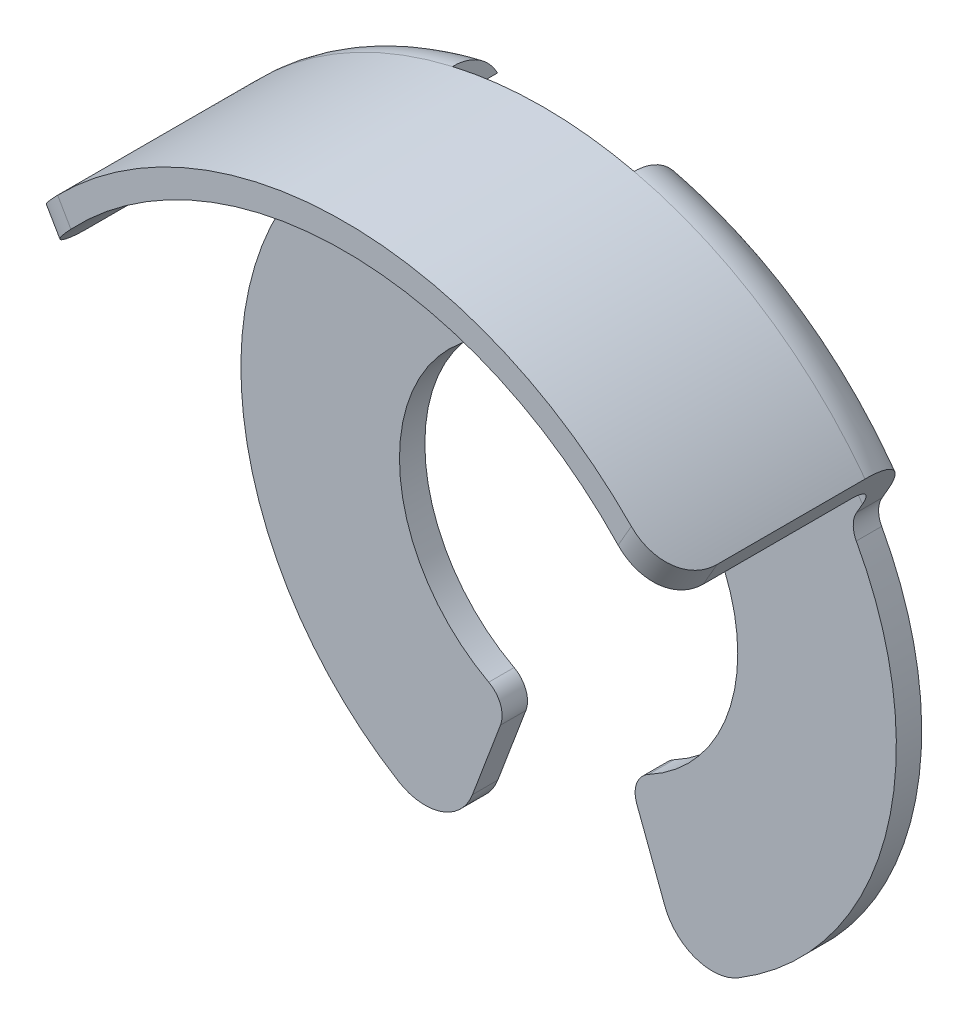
ISO-10303-21;
HEADER;
FILE_DESCRIPTION(('STEP AP214'),'2;1');
FILE_NAME('part.step','',(''),(''),'','','');
FILE_SCHEMA(('AUTOMOTIVE_DESIGN { 1 0 10303 214 1 1 1 1 }'));
ENDSEC;
DATA;
#1=APPLICATION_CONTEXT('core data for automotive mechanical design processes');
#2=APPLICATION_PROTOCOL_DEFINITION('international standard','automotive_design',2000,#1);
#3=PRODUCT_CONTEXT('',#1,'mechanical');
#4=PRODUCT('Part','Part','',(#3));
#5=PRODUCT_RELATED_PRODUCT_CATEGORY('part','',(#4));
#6=PRODUCT_DEFINITION_FORMATION('','',#4);
#7=PRODUCT_DEFINITION_CONTEXT('part definition',#1,'design');
#8=PRODUCT_DEFINITION('design','',#6,#7);
#9=PRODUCT_DEFINITION_SHAPE('','',#8);
#10=(LENGTH_UNIT() NAMED_UNIT(*) SI_UNIT(.MILLI.,.METRE.));
#11=(NAMED_UNIT(*) PLANE_ANGLE_UNIT() SI_UNIT($,.RADIAN.));
#12=(NAMED_UNIT(*) SI_UNIT($,.STERADIAN.) SOLID_ANGLE_UNIT());
#13=UNCERTAINTY_MEASURE_WITH_UNIT(LENGTH_MEASURE(1.E-05),#10,'distance_accuracy_value','');
#14=(GEOMETRIC_REPRESENTATION_CONTEXT(3) GLOBAL_UNCERTAINTY_ASSIGNED_CONTEXT((#13)) GLOBAL_UNIT_ASSIGNED_CONTEXT((#10,
#11,#12)) REPRESENTATION_CONTEXT('',''));
#15=CARTESIAN_POINT('',(0.,0.,0.));
#16=DIRECTION('',(0.,0.,1.));
#17=DIRECTION('',(1.,0.,0.));
#18=AXIS2_PLACEMENT_3D('',#15,#16,#17);
#19=CARTESIAN_POINT('',(0.,0.,-5.3));
#20=DIRECTION('',(0.,0.,1.));
#21=DIRECTION('',(1.,0.,0.));
#22=AXIS2_PLACEMENT_3D('',#19,#20,#21);
#23=CYLINDRICAL_SURFACE('',#22,8.9);
#24=CARTESIAN_POINT('',(0.,0.,-4.7));
#25=DIRECTION('',(0.,0.,1.));
#26=DIRECTION('',(1.,0.,0.));
#27=AXIS2_PLACEMENT_3D('',#24,#25,#26);
#28=CIRCLE('',#27,8.9);
#29=CARTESIAN_POINT('',(-7.2824341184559,5.11626360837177,-4.7));
#30=VERTEX_POINT('',#29);
#31=CARTESIAN_POINT('',(-2.14909721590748,8.63663019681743,-4.7));
#32=VERTEX_POINT('',#31);
#33=EDGE_CURVE('E282',#30,#32,#28,.F.);
#34=ORIENTED_EDGE('',*,*,#33,.T.);
#35=CARTESIAN_POINT('',(0.,0.,-4.7));
#36=DIRECTION('',(0.,0.,1.));
#37=DIRECTION('',(1.,0.,0.));
#38=AXIS2_PLACEMENT_3D('',#35,#36,#37);
#39=CIRCLE('',#38,8.9);
#40=CARTESIAN_POINT('',(2.14909721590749,8.63663019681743,-4.7));
#41=VERTEX_POINT('',#40);
#42=EDGE_CURVE('E268',#32,#41,#39,.F.);
#43=ORIENTED_EDGE('',*,*,#42,.T.);
#44=CARTESIAN_POINT('',(7.2824341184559,5.11626360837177,-4.7));
#45=VERTEX_POINT('',#44);
#46=EDGE_CURVE('E275',#41,#45,#39,.F.);
#47=ORIENTED_EDGE('',*,*,#46,.T.);
#48=DIRECTION('',(0.,0.,1.));
#49=VECTOR('',#48,1.);
#50=CARTESIAN_POINT('',(7.2824341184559,5.11626360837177,-5.3));
#51=LINE('',#50,#49);
#52=CARTESIAN_POINT('',(7.2824341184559,5.11626360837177,-1.2));
#53=VERTEX_POINT('',#52);
#54=EDGE_CURVE('E615',#45,#53,#51,.T.);
#55=ORIENTED_EDGE('',*,*,#54,.T.);
#56=CARTESIAN_POINT('',(7.2824341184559,5.11626360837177,-1.2));
#57=CARTESIAN_POINT('',(7.28243440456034,5.11626135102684,-1.16828015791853));
#58=CARTESIAN_POINT('',(7.28163646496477,5.1173991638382,-1.1365766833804));
#59=CARTESIAN_POINT('',(7.27845613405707,5.12192227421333,-1.07341979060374));
#60=CARTESIAN_POINT('',(7.27607421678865,5.12530689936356,-1.04196630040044));
#61=CARTESIAN_POINT('',(7.26659844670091,5.13874240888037,-0.948560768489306));
#62=CARTESIAN_POINT('',(7.25717430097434,5.15207558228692,-0.887272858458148));
#63=CARTESIAN_POINT('',(7.23241951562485,5.18676724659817,-0.768374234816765));
#64=CARTESIAN_POINT('',(7.21709303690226,5.20812008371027,-0.710760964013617));
#65=CARTESIAN_POINT('',(7.18095786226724,5.25783091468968,-0.600455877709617));
#66=CARTESIAN_POINT('',(7.16014526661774,5.28619389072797,-0.547767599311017));
#67=CARTESIAN_POINT('',(7.11247665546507,5.35017138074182,-0.446163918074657));
#68=CARTESIAN_POINT('',(7.08538919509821,5.38605662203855,-0.39752834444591));
#69=CARTESIAN_POINT('',(7.02635080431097,5.46285088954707,-0.307751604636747));
#70=CARTESIAN_POINT('',(6.99439801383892,5.50376183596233,-0.266613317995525));
#71=CARTESIAN_POINT('',(6.92339424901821,5.59286279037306,-0.18947768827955));
#72=CARTESIAN_POINT('',(6.8839740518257,5.64137517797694,-0.154191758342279));
#73=CARTESIAN_POINT('',(6.80095674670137,5.74118468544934,-0.0940256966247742));
#74=CARTESIAN_POINT('',(6.75736022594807,5.79248141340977,-0.0691441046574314));
#75=CARTESIAN_POINT('',(6.67379952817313,5.88844587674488,-0.033357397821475));
#76=CARTESIAN_POINT('',(6.6342892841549,5.93293718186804,-0.0209035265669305));
#77=CARTESIAN_POINT('',(6.55362641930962,6.02193125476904,-0.00421979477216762));
#78=CARTESIAN_POINT('',(6.51247454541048,6.06643400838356,1.37633535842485E-05));
#79=CARTESIAN_POINT('',(6.47082575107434,6.11051668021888,0.));
#80=B_SPLINE_CURVE_WITH_KNOTS('',3,(#56,#57,#58,#59,#60,#61,#62,#63,#64,#65,#66,#67,#68,#69,#70,
#71,#72,#73,#74,#75,#76,#77,#78,#79),.UNSPECIFIED.,.F.,.F.,(4,2,2,2,2,2,2,2,2,2,2,4),(0.,
0.0950972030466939,0.190165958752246,0.379442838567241,0.568586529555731,0.757865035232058,
0.955735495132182,1.15368179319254,1.36807934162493,1.5824467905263,1.76425724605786,
1.94598590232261),.UNSPECIFIED.);
#81=CARTESIAN_POINT('',(6.47082575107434,6.11051668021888,0.));
#82=VERTEX_POINT('',#81);
#83=EDGE_CURVE('E381',#53,#82,#80,.T.);
#84=ORIENTED_EDGE('',*,*,#83,.T.);
#85=CARTESIAN_POINT('',(0.,0.,0.));
#86=DIRECTION('',(0.,0.,1.));
#87=DIRECTION('',(1.,0.,0.));
#88=AXIS2_PLACEMENT_3D('',#85,#86,#87);
#89=CIRCLE('',#88,8.9);
#90=CARTESIAN_POINT('',(-6.47082575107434,6.11051668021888,0.));
#91=VERTEX_POINT('',#90);
#92=EDGE_CURVE('E602',#82,#91,#89,.T.);
#93=ORIENTED_EDGE('',*,*,#92,.T.);
#94=CARTESIAN_POINT('',(-6.47082575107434,6.11051668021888,0.));
#95=CARTESIAN_POINT('',(-6.5218702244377,6.05651278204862,3.52825340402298E-05));
#96=CARTESIAN_POINT('',(-6.5721529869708,6.00186059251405,-0.00633394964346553));
#97=CARTESIAN_POINT('',(-6.6699630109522,5.89294348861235,-0.0312951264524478));
#98=CARTESIAN_POINT('',(-6.71749216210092,5.83867833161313,-0.0498785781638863));
#99=CARTESIAN_POINT('',(-6.80863026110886,5.73214757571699,-0.0986797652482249));
#100=CARTESIAN_POINT('',(-6.85223979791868,5.67988167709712,-0.128895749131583));
#101=CARTESIAN_POINT('',(-6.93459074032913,5.57903939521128,-0.200204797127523));
#102=CARTESIAN_POINT('',(-6.973331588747,5.53046343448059,-0.241299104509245));
#103=CARTESIAN_POINT('',(-7.04517881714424,5.43864619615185,-0.3336187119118));
#104=CARTESIAN_POINT('',(-7.07826564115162,5.395423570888,-0.384877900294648));
#105=CARTESIAN_POINT('',(-7.13779007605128,5.31642780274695,-0.496280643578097));
#106=CARTESIAN_POINT('',(-7.16422849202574,5.28065375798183,-0.556423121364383));
#107=CARTESIAN_POINT('',(-7.20837601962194,5.22021493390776,-0.680454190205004));
#108=CARTESIAN_POINT('',(-7.22648525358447,5.19504737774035,-0.743954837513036));
#109=CARTESIAN_POINT('',(-7.25537816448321,5.1546208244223,-0.875555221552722));
#110=CARTESIAN_POINT('',(-7.266176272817,5.13934230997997,-0.94364560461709));
#111=CARTESIAN_POINT('',(-7.27621665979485,5.12510436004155,-1.04372516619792));
#112=CARTESIAN_POINT('',(-7.2785471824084,5.12179273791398,-1.07485858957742));
#113=CARTESIAN_POINT('',(-7.28165476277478,5.11737321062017,-1.13732182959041));
#114=CARTESIAN_POINT('',(-7.28243362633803,5.11626274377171,-1.16865137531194));
#115=CARTESIAN_POINT('',(-7.28243411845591,5.11626360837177,-1.2));
#116=B_SPLINE_CURVE_WITH_KNOTS('',3,(#94,#95,#96,#97,#98,#99,#100,#101,#102,#103,#104,#105,#106,
#107,#108,#109,#110,#111,#112,#113,#114,#115),.UNSPECIFIED.,.F.,.F.,(4,2,2,2,2,2,2,2,2,2,4),(0.,
0.222579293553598,0.445003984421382,0.667395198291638,0.889811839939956,1.11298284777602,
1.33612681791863,1.54699837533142,1.75745247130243,1.85154118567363,1.94552033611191),.UNSPECIFIED.);
#117=CARTESIAN_POINT('',(-7.2824341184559,5.11626360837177,-1.2));
#118=VERTEX_POINT('',#117);
#119=EDGE_CURVE('E372',#91,#118,#116,.T.);
#120=ORIENTED_EDGE('',*,*,#119,.T.);
#121=DIRECTION('',(0.,0.,1.));
#122=VECTOR('',#121,1.);
#123=CARTESIAN_POINT('',(-7.2824341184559,5.11626360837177,-5.3));
#124=LINE('',#123,#122);
#125=EDGE_CURVE('E622',#118,#30,#124,.F.);
#126=ORIENTED_EDGE('',*,*,#125,.T.);
#127=EDGE_LOOP('',(#34,#43,#47,#55,#84,#93,#120,#126));
#128=FACE_BOUND('',#127,.T.);
#129=ADVANCED_FACE('F39',(#128),#23,.F.);
#130=CARTESIAN_POINT('',(-1.56437844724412,7.53941112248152,-5.9));
#131=DIRECTION('',(0.,0.,1.));
#132=DIRECTION('',(1.,0.,0.));
#133=AXIS2_PLACEMENT_3D('',#130,#131,#132);
#134=CYLINDRICAL_SURFACE('',#133,1.2);
#135=DIRECTION('',(0.,0.,1.));
#136=VECTOR('',#135,1.);
#137=CARTESIAN_POINT('',(-2.14909721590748,8.58731567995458,-5.9));
#138=LINE('',#137,#136);
#139=CARTESIAN_POINT('',(-2.14909721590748,8.58731567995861,-4.93479197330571));
#140=VERTEX_POINT('',#139);
#141=CARTESIAN_POINT('',(-2.14909721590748,8.58731567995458,-5.7654235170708));
#142=VERTEX_POINT('',#141);
#143=EDGE_CURVE('E726',#140,#142,#138,.F.);
#144=ORIENTED_EDGE('',*,*,#143,.F.);
#145=CARTESIAN_POINT('',(-2.72625415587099,7.83948584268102,-5.3));
#146=CARTESIAN_POINT('',(-2.71979662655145,7.8645090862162,-5.29999765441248));
#147=CARTESIAN_POINT('',(-2.712529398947,7.88928810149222,-5.29884376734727));
#148=CARTESIAN_POINT('',(-2.69649518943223,7.93811898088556,-5.29450620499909));
#149=CARTESIAN_POINT('',(-2.6877314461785,7.96217228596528,-5.29132687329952));
#150=CARTESIAN_POINT('',(-2.65954713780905,8.03249777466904,-5.27924490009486));
#151=CARTESIAN_POINT('',(-2.63807870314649,8.07752359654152,-5.26778524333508));
#152=CARTESIAN_POINT('',(-2.58553282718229,8.17249319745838,-5.23681722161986));
#153=CARTESIAN_POINT('',(-2.55338239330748,8.22143297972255,-5.21611246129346));
#154=CARTESIAN_POINT('',(-2.48368288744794,8.31284769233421,-5.1695036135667));
#155=CARTESIAN_POINT('',(-2.44610642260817,8.35528742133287,-5.14357286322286));
#156=CARTESIAN_POINT('',(-2.35341154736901,8.44658740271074,-5.07887571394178));
#157=CARTESIAN_POINT('',(-2.29664870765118,8.49279243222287,-5.03872844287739));
#158=CARTESIAN_POINT('',(-2.17777154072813,8.57328675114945,-4.9548915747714));
#159=CARTESIAN_POINT('',(-2.11566162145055,8.60758574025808,-4.91120489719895));
#160=CARTESIAN_POINT('',(-2.01326756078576,8.65308089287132,-4.83996688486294));
#161=CARTESIAN_POINT('',(-1.97421164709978,8.66802707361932,-4.81296543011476));
#162=CARTESIAN_POINT('',(-1.89499892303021,8.69371618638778,-4.7586707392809));
#163=CARTESIAN_POINT('',(-1.8548437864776,8.70446516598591,-4.73137798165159));
#164=CARTESIAN_POINT('',(-1.81223878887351,8.71353613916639,-4.70272865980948));
#165=CARTESIAN_POINT('',(-1.81020875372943,8.71396285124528,-4.70136430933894));
#166=CARTESIAN_POINT('',(-1.80817768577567,8.71438428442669,-4.7));
#167=B_SPLINE_CURVE_WITH_KNOTS('',3,(#145,#146,#147,#148,#149,#150,#151,#152,#153,#154,#155,
#156,#157,#158,#159,#160,#161,#162,#163,#164,#165,#166),.UNSPECIFIED.,.F.,.F.,(4,2,2,2,2,2,2,2,
2,2,4),(0.,0.0774357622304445,0.154706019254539,0.307452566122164,0.492827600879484,
0.679173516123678,0.928310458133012,1.1772439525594,1.32641716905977,1.47537464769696,
1.48282318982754),.UNSPECIFIED.);
#168=CARTESIAN_POINT('',(-2.72625415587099,7.83948584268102,-5.3));
#169=VERTEX_POINT('',#168);
#170=EDGE_CURVE('E464',#140,#169,#167,.F.);
#171=ORIENTED_EDGE('',*,*,#170,.T.);
#172=CARTESIAN_POINT('',(-1.56437844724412,7.53941112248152,-5.3));
#173=DIRECTION('',(0.,0.,1.));
#174=DIRECTION('',(-1.,0.,0.));
#175=AXIS2_PLACEMENT_3D('',#172,#173,#174);
#176=CIRCLE('',#175,1.2);
#177=CARTESIAN_POINT('',(-2.68700069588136,7.11547800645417,-5.3));
#178=VERTEX_POINT('',#177);
#179=EDGE_CURVE('E548',#169,#178,#176,.T.);
#180=ORIENTED_EDGE('',*,*,#179,.T.);
#181=DIRECTION('',(0.,0.,1.));
#182=VECTOR('',#181,1.);
#183=CARTESIAN_POINT('',(-2.68700069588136,7.11547800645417,-5.9));
#184=LINE('',#183,#182);
#185=CARTESIAN_POINT('',(-2.68700069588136,7.11547800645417,-5.9));
#186=VERTEX_POINT('',#185);
#187=EDGE_CURVE('E553',#186,#178,#184,.T.);
#188=ORIENTED_EDGE('',*,*,#187,.F.);
#189=CARTESIAN_POINT('',(-1.56437844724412,7.53941112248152,-5.9));
#190=DIRECTION('',(0.,0.,1.));
#191=DIRECTION('',(-1.,0.,0.));
#192=AXIS2_PLACEMENT_3D('',#189,#190,#191);
#193=CIRCLE('',#192,1.2);
#194=CARTESIAN_POINT('',(-2.72625415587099,7.83948584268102,-5.9));
#195=VERTEX_POINT('',#194);
#196=EDGE_CURVE('E522',#195,#186,#193,.T.);
#197=ORIENTED_EDGE('',*,*,#196,.F.);
#198=CARTESIAN_POINT('',(-2.72625415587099,7.83948584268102,-5.9));
#199=CARTESIAN_POINT('',(-2.71818549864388,7.87073827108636,-5.90000019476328));
#200=CARTESIAN_POINT('',(-2.70885765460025,7.90163455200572,-5.89909773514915));
#201=CARTESIAN_POINT('',(-2.68778950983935,7.96247345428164,-5.89576805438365));
#202=CARTESIAN_POINT('',(-2.67605185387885,7.99241707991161,-5.89334249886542));
#203=CARTESIAN_POINT('',(-2.63750484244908,8.08021108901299,-5.88423379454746));
#204=CARTESIAN_POINT('',(-2.60726354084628,8.13639924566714,-5.8757119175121));
#205=CARTESIAN_POINT('',(-2.53873302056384,8.24270916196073,-5.85599093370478));
#206=CARTESIAN_POINT('',(-2.50047416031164,8.29285271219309,-5.84480190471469));
#207=CARTESIAN_POINT('',(-2.41659890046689,8.38657107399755,-5.82176417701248));
#208=CARTESIAN_POINT('',(-2.3709675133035,8.43013214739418,-5.80991416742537));
#209=CARTESIAN_POINT('',(-2.26911297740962,8.5130745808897,-5.7866164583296));
#210=CARTESIAN_POINT('',(-2.21232138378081,8.55179466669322,-5.77528675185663));
#211=CARTESIAN_POINT('',(-2.09252787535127,8.61910952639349,-5.75659479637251));
#212=CARTESIAN_POINT('',(-2.02954315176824,8.64773137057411,-5.74922191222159));
#213=CARTESIAN_POINT('',(-1.93897651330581,8.67976737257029,-5.74286737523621));
#214=CARTESIAN_POINT('',(-1.91316138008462,8.68792535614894,-5.74150946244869));
#215=CARTESIAN_POINT('',(-1.86102347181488,8.70248135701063,-5.739690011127));
#216=CARTESIAN_POINT('',(-1.83470097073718,8.70888029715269,-5.73922800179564));
#217=CARTESIAN_POINT('',(-1.80817768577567,8.71438428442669,-5.73923048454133));
#218=B_SPLINE_CURVE_WITH_KNOTS('',3,(#198,#199,#200,#201,#202,#203,#204,#205,#206,#207,#208,
#209,#210,#211,#212,#213,#214,#215,#216,#217),.UNSPECIFIED.,.F.,.F.,(4,2,2,2,2,2,2,2,2,4),(0.,
0.0967417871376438,0.193377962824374,0.38550555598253,0.576918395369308,0.768725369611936,
0.976690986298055,1.18409479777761,1.26535427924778,1.34657104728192),.UNSPECIFIED.);
#219=EDGE_CURVE('E382',#195,#142,#218,.T.);
#220=ORIENTED_EDGE('',*,*,#219,.T.);
#221=EDGE_LOOP('',(#144,#171,#180,#188,#197,#220));
#222=FACE_BOUND('',#221,.T.);
#223=ADVANCED_FACE('F397',(#222),#134,.F.);
#224=CARTESIAN_POINT('',(1.56437844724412,7.53941112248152,-5.9));
#225=DIRECTION('',(0.,0.,1.));
#226=DIRECTION('',(1.,0.,0.));
#227=AXIS2_PLACEMENT_3D('',#224,#225,#226);
#228=CYLINDRICAL_SURFACE('',#227,1.2);
#229=DIRECTION('',(0.,0.,1.));
#230=VECTOR('',#229,1.);
#231=CARTESIAN_POINT('',(2.14909721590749,8.58731567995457,-5.9));
#232=LINE('',#231,#230);
#233=CARTESIAN_POINT('',(2.14909721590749,8.58731567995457,-5.76542351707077));
#234=VERTEX_POINT('',#233);
#235=CARTESIAN_POINT('',(2.14909721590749,8.58731567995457,-4.93479197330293));
#236=VERTEX_POINT('',#235);
#237=EDGE_CURVE('E260',#234,#236,#232,.T.);
#238=ORIENTED_EDGE('',*,*,#237,.F.);
#239=CARTESIAN_POINT('',(1.80817768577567,8.71438428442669,-5.73923048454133));
#240=CARTESIAN_POINT('',(1.83985029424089,8.70781450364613,-5.73922164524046));
#241=CARTESIAN_POINT('',(1.87123812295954,8.69996312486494,-5.73988480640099));
#242=CARTESIAN_POINT('',(1.93321236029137,8.68177860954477,-5.74247408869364));
#243=CARTESIAN_POINT('',(1.96379925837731,8.6714470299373,-5.74439941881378));
#244=CARTESIAN_POINT('',(2.0536885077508,8.63698556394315,-5.75191664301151));
#245=CARTESIAN_POINT('',(2.11152634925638,8.60930350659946,-5.75925179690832));
#246=CARTESIAN_POINT('',(2.22153504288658,8.5454885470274,-5.77712629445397));
#247=CARTESIAN_POINT('',(2.27371751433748,8.5093734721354,-5.787658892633));
#248=CARTESIAN_POINT('',(2.37170526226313,8.42948227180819,-5.81009385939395));
#249=CARTESIAN_POINT('',(2.41749540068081,8.38568849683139,-5.82199936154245));
#250=CARTESIAN_POINT('',(2.50467349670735,8.28802990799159,-5.84596743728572));
#251=CARTESIAN_POINT('',(2.54552481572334,8.23367322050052,-5.85798209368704));
#252=CARTESIAN_POINT('',(2.61760484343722,8.11846265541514,-5.87864210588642));
#253=CARTESIAN_POINT('',(2.64886352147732,8.05762982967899,-5.88729797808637));
#254=CARTESIAN_POINT('',(2.68507848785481,7.96926426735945,-5.89517977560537));
#255=CARTESIAN_POINT('',(2.69453821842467,7.9437391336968,-5.89694540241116));
#256=CARTESIAN_POINT('',(2.71171567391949,7.89205565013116,-5.899355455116));
#257=CARTESIAN_POINT('',(2.71943320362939,7.86589722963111,-5.89999975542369));
#258=CARTESIAN_POINT('',(2.72625415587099,7.83948584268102,-5.9));
#259=B_SPLINE_CURVE_WITH_KNOTS('',3,(#239,#240,#241,#242,#243,#244,#245,#246,#247,#248,#249,
#250,#251,#252,#253,#254,#255,#256,#257,#258),.UNSPECIFIED.,.F.,.F.,(4,2,2,2,2,2,2,2,2,4),(0.,
0.0969720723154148,0.193883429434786,0.386476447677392,0.578665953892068,0.771303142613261,
0.977498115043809,1.18304217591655,1.26480654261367,1.34658006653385),.UNSPECIFIED.);
#260=CARTESIAN_POINT('',(2.72625415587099,7.83948584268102,-5.9));
#261=VERTEX_POINT('',#260);
#262=EDGE_CURVE('E821',#234,#261,#259,.T.);
#263=ORIENTED_EDGE('',*,*,#262,.T.);
#264=CARTESIAN_POINT('',(1.56437844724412,7.53941112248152,-5.9));
#265=DIRECTION('',(0.,0.,1.));
#266=DIRECTION('',(-1.,0.,0.));
#267=AXIS2_PLACEMENT_3D('',#264,#265,#266);
#268=CIRCLE('',#267,1.2);
#269=CARTESIAN_POINT('',(2.68700069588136,7.11547800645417,-5.9));
#270=VERTEX_POINT('',#269);
#271=EDGE_CURVE('E518',#270,#261,#268,.T.);
#272=ORIENTED_EDGE('',*,*,#271,.F.);
#273=DIRECTION('',(0.,0.,1.));
#274=VECTOR('',#273,1.);
#275=CARTESIAN_POINT('',(2.68700069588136,7.11547800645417,-5.9));
#276=LINE('',#275,#274);
#277=CARTESIAN_POINT('',(2.68700069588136,7.11547800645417,-5.3));
#278=VERTEX_POINT('',#277);
#279=EDGE_CURVE('E558',#270,#278,#276,.T.);
#280=ORIENTED_EDGE('',*,*,#279,.T.);
#281=CARTESIAN_POINT('',(1.56437844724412,7.53941112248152,-5.3));
#282=DIRECTION('',(0.,0.,1.));
#283=DIRECTION('',(-1.,0.,0.));
#284=AXIS2_PLACEMENT_3D('',#281,#282,#283);
#285=CIRCLE('',#284,1.2);
#286=CARTESIAN_POINT('',(2.72625415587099,7.83948584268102,-5.3));
#287=VERTEX_POINT('',#286);
#288=EDGE_CURVE('E544',#278,#287,#285,.T.);
#289=ORIENTED_EDGE('',*,*,#288,.T.);
#290=CARTESIAN_POINT('',(2.72625415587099,7.83948584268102,-5.3));
#291=CARTESIAN_POINT('',(2.71979662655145,7.8645090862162,-5.29999765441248));
#292=CARTESIAN_POINT('',(2.712529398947,7.88928810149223,-5.29884376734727));
#293=CARTESIAN_POINT('',(2.69649518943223,7.93811898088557,-5.29450620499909));
#294=CARTESIAN_POINT('',(2.68773144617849,7.9621722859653,-5.29132687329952));
#295=CARTESIAN_POINT('',(2.65954713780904,8.03249777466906,-5.27924490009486));
#296=CARTESIAN_POINT('',(2.63807870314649,8.07752359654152,-5.26778524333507));
#297=CARTESIAN_POINT('',(2.58553282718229,8.17249319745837,-5.23681722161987));
#298=CARTESIAN_POINT('',(2.55338239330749,8.22143297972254,-5.21611246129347));
#299=CARTESIAN_POINT('',(2.48368288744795,8.31284769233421,-5.16950361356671));
#300=CARTESIAN_POINT('',(2.44610642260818,8.35528742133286,-5.14357286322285));
#301=CARTESIAN_POINT('',(2.353411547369,8.44658740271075,-5.0788757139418));
#302=CARTESIAN_POINT('',(2.29664870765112,8.49279243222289,-5.03872844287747));
#303=CARTESIAN_POINT('',(2.17777154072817,8.57328675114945,-4.95489157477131));
#304=CARTESIAN_POINT('',(2.11566162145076,8.60758574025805,-4.91120489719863));
#305=CARTESIAN_POINT('',(2.01326756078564,8.65308089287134,-4.83996688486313));
#306=CARTESIAN_POINT('',(1.97421164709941,8.6680270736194,-4.81296543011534));
#307=CARTESIAN_POINT('',(1.8949989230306,8.6937161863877,-4.7586707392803));
#308=CARTESIAN_POINT('',(1.85484378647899,8.70446516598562,-4.73137798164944));
#309=CARTESIAN_POINT('',(1.81223878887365,8.71353613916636,-4.70272865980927));
#310=CARTESIAN_POINT('',(1.8102087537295,8.71396285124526,-4.70136430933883));
#311=CARTESIAN_POINT('',(1.80817768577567,8.71438428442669,-4.7));
#312=B_SPLINE_CURVE_WITH_KNOTS('',3,(#290,#291,#292,#293,#294,#295,#296,#297,#298,#299,#300,
#301,#302,#303,#304,#305,#306,#307,#308,#309,#310,#311),.UNSPECIFIED.,.F.,.F.,(4,2,2,2,2,2,2,2,
2,2,4),(0.,0.0774357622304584,0.154706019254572,0.307452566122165,0.492827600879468,
0.67917351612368,0.928310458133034,1.1772439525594,1.32641716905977,1.47537464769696,
1.48282318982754),.UNSPECIFIED.);
#313=EDGE_CURVE('E305',#287,#236,#312,.T.);
#314=ORIENTED_EDGE('',*,*,#313,.T.);
#315=EDGE_LOOP('',(#238,#263,#272,#280,#289,#314));
#316=FACE_BOUND('',#315,.T.);
#317=ADVANCED_FACE('F319',(#316),#228,.F.);
#318=CARTESIAN_POINT('',(0.,0.,-4.7));
#319=DIRECTION('',(0.,0.,1.));
#320=DIRECTION('',(1.,0.,0.));
#321=AXIS2_PLACEMENT_3D('',#318,#319,#320);
#322=TOROIDAL_SURFACE('',#321,8.3,1.2);
#323=ORIENTED_EDGE('',*,*,#262,.F.);
#324=CARTESIAN_POINT('',(2.14909721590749,6.82667194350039,-5.06531947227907));
#325=CARTESIAN_POINT('',(2.14909721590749,6.84807091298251,-5.12917266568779));
#326=CARTESIAN_POINT('',(2.14909721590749,6.87505575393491,-5.1912171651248));
#327=CARTESIAN_POINT('',(2.14909721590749,6.93920462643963,-5.30987360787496));
#328=CARTESIAN_POINT('',(2.14909721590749,6.97638524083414,-5.36647649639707));
#329=CARTESIAN_POINT('',(2.14909721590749,7.05954218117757,-5.47258450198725));
#330=CARTESIAN_POINT('',(2.14909721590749,7.10549810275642,-5.52210562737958));
#331=CARTESIAN_POINT('',(2.14909721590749,7.20481697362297,-5.61300749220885));
#332=CARTESIAN_POINT('',(2.14909721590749,7.25817822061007,-5.65439009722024));
#333=CARTESIAN_POINT('',(2.14909721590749,7.3726170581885,-5.72930282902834));
#334=CARTESIAN_POINT('',(2.14909721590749,7.43388706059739,-5.76253898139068));
#335=CARTESIAN_POINT('',(2.14909721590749,7.56101031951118,-5.81863627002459));
#336=CARTESIAN_POINT('',(2.14909721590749,7.62686460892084,-5.84149505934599));
#337=CARTESIAN_POINT('',(2.14909721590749,7.76361709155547,-5.87688095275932));
#338=CARTESIAN_POINT('',(2.14909721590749,7.8346099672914,-5.88904307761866));
#339=CARTESIAN_POINT('',(2.14909721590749,7.97763425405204,-5.90139854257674));
#340=CARTESIAN_POINT('',(2.14909721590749,8.04966575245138,-5.90159086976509));
#341=CARTESIAN_POINT('',(2.14909721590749,8.19340366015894,-5.88988176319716));
#342=CARTESIAN_POINT('',(2.14909721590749,8.2651012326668,-5.87787090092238));
#343=CARTESIAN_POINT('',(2.14909721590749,8.40540719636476,-5.84180871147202));
#344=CARTESIAN_POINT('',(2.14909721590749,8.47401575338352,-5.81775803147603));
#345=CARTESIAN_POINT('',(2.14909721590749,8.60511494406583,-5.75859438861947));
#346=CARTESIAN_POINT('',(2.14909721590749,8.66767880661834,-5.72364389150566));
#347=CARTESIAN_POINT('',(2.14909721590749,8.78582797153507,-5.6434531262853));
#348=CARTESIAN_POINT('',(2.14909721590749,8.84141428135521,-5.59821434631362));
#349=CARTESIAN_POINT('',(2.14909721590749,8.94238284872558,-5.50005420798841));
#350=CARTESIAN_POINT('',(2.14909721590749,8.98800358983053,-5.44737820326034));
#351=CARTESIAN_POINT('',(2.14909721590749,9.06944368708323,-5.33492561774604));
#352=CARTESIAN_POINT('',(2.14909721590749,9.10526469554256,-5.27515023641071));
#353=CARTESIAN_POINT('',(2.14909721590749,9.16503783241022,-5.15202458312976));
#354=CARTESIAN_POINT('',(2.14909721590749,9.1892972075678,-5.08882338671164));
#355=CARTESIAN_POINT('',(2.14909721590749,9.2266225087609,-4.95919849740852));
#356=CARTESIAN_POINT('',(2.14909721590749,9.23968985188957,-4.8927752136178));
#357=CARTESIAN_POINT('',(2.14909721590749,9.25405357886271,-4.75998051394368));
#358=CARTESIAN_POINT('',(2.14909721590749,9.25557413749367,-4.69363325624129));
#359=CARTESIAN_POINT('',(2.14909721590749,9.24738688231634,-4.56163781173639));
#360=CARTESIAN_POINT('',(2.14909721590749,9.23767966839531,-4.49598958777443));
#361=CARTESIAN_POINT('',(2.14909721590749,9.20743587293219,-4.36761934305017));
#362=CARTESIAN_POINT('',(2.14909721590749,9.18695851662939,-4.30488334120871));
#363=CARTESIAN_POINT('',(2.14909721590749,9.1358583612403,-4.18369336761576));
#364=CARTESIAN_POINT('',(2.14909721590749,9.10523530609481,-4.12523950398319));
#365=CARTESIAN_POINT('',(2.14909721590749,9.0344480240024,-4.0136462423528));
#366=CARTESIAN_POINT('',(2.14909721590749,8.99419558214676,-3.96056284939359));
#367=CARTESIAN_POINT('',(2.14909721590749,8.90552543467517,-3.86172709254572));
#368=CARTESIAN_POINT('',(2.14909721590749,8.85710698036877,-3.81597540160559));
#369=CARTESIAN_POINT('',(2.14909721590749,8.7523677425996,-3.73200892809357));
#370=CARTESIAN_POINT('',(2.14909721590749,8.69589713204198,-3.69398112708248));
#371=CARTESIAN_POINT('',(2.14909721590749,8.57751430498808,-3.62764253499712));
#372=CARTESIAN_POINT('',(2.14909721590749,8.51560134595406,-3.59933307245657));
#373=CARTESIAN_POINT('',(2.14909721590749,8.38621669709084,-3.55238470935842));
#374=CARTESIAN_POINT('',(2.14909721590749,8.31863709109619,-3.53404320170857));
#375=CARTESIAN_POINT('',(2.14909721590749,8.18138938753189,-3.50864975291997));
#376=CARTESIAN_POINT('',(2.14909721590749,8.11172098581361,-3.50159946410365));
#377=CARTESIAN_POINT('',(2.14909721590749,7.97035627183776,-3.49885142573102));
#378=CARTESIAN_POINT('',(2.14909721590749,7.89865406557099,-3.50345165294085));
#379=CARTESIAN_POINT('',(2.14909721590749,7.75699858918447,-3.52447204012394));
#380=CARTESIAN_POINT('',(2.14909721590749,7.68704551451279,-3.54089351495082));
#381=CARTESIAN_POINT('',(2.14909721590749,7.55003261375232,-3.58540238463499));
#382=CARTESIAN_POINT('',(2.14909721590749,7.48301663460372,-3.61362506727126));
#383=CARTESIAN_POINT('',(2.14909721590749,7.3547481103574,-3.6810539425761));
#384=CARTESIAN_POINT('',(2.14909721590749,7.29349549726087,-3.72026000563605));
#385=CARTESIAN_POINT('',(2.14909721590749,7.17939058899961,-3.80812773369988));
#386=CARTESIAN_POINT('',(2.14909721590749,7.12644373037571,-3.85666639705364));
#387=CARTESIAN_POINT('',(2.14909721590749,7.02983141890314,-3.96224254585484));
#388=CARTESIAN_POINT('',(2.14909721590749,6.98616363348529,-4.01927788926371));
#389=CARTESIAN_POINT('',(2.14909721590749,6.91112475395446,-4.13800917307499));
#390=CARTESIAN_POINT('',(2.14909721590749,6.87936015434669,-4.19945624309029));
#391=CARTESIAN_POINT('',(2.14909721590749,6.82712932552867,-4.32699948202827));
#392=CARTESIAN_POINT('',(2.14909721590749,6.80666278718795,-4.3930955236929));
#393=CARTESIAN_POINT('',(2.14909721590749,6.77848178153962,-4.5249803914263));
#394=CARTESIAN_POINT('',(2.14909721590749,6.77025873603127,-4.59066115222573));
#395=CARTESIAN_POINT('',(2.14909721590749,6.76526003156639,-4.72239380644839));
#396=CARTESIAN_POINT('',(2.14909721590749,6.76846729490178,-4.78844499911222));
#397=CARTESIAN_POINT('',(2.14909721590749,6.78216771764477,-4.88963252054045));
#398=CARTESIAN_POINT('',(2.14909721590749,6.78874611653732,-4.92534255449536));
#399=CARTESIAN_POINT('',(2.14909721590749,6.8052331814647,-4.99598323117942));
#400=CARTESIAN_POINT('',(2.14909721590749,6.81514168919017,-5.03091391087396));
#401=CARTESIAN_POINT('',(2.14909721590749,6.82667194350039,-5.06531947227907));
#402=B_SPLINE_CURVE_WITH_KNOTS('',3,(#324,#325,#326,#327,#328,#329,#330,#331,#332,#333,#334,
#335,#336,#337,#338,#339,#340,#341,#342,#343,#344,#345,#346,#347,#348,#349,#350,#351,#352,#353,
#354,#355,#356,#357,#358,#359,#360,#361,#362,#363,#364,#365,#366,#367,#368,#369,#370,#371,#372,
#373,#374,#375,#376,#377,#378,#379,#380,#381,#382,#383,#384,#385,#386,#387,#388,#389,#390,#391,
#392,#393,#394,#395,#396,#397,#398,#399,#400,#401),.UNSPECIFIED.,.T.,.F.,(4,2,2,2,2,2,2,2,2,2,2,
2,2,2,2,2,2,2,2,2,2,2,2,2,2,2,2,2,2,2,2,2,2,2,2,2,2,2,4),(0.,0.201891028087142,
0.404112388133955,0.605869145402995,0.807579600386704,1.01575092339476,1.22396930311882,
1.43904377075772,1.6541364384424,1.87117505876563,2.08820201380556,2.30213736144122,
2.51604178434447,2.72406655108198,2.93205622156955,3.13415880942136,3.33623580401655,
3.53437929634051,3.73251220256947,3.92956679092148,4.12662635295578,4.32556540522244,
4.52452270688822,4.72783676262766,4.93117860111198,5.14029382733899,5.34943965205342,
5.56398837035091,5.77856095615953,5.99566390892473,6.21276429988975,6.4271783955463,
6.64153852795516,6.84800728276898,7.05447038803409,7.25209159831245,7.44941767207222,
7.55820634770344,7.66698985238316),.UNSPECIFIED.);
#403=CARTESIAN_POINT('',(2.14909721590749,9.25372255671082,-4.7));
#404=VERTEX_POINT('',#403);
#405=EDGE_CURVE('E491',#234,#404,#402,.T.);
#406=ORIENTED_EDGE('',*,*,#405,.T.);
#407=CARTESIAN_POINT('',(0.,0.,-4.7));
#408=DIRECTION('',(0.,0.,1.));
#409=DIRECTION('',(1.,0.,0.));
#410=AXIS2_PLACEMENT_3D('',#407,#408,#409);
#411=CIRCLE('',#410,9.5);
#412=CARTESIAN_POINT('',(7.6109828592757,5.68532672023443,-4.7));
#413=VERTEX_POINT('',#412);
#414=EDGE_CURVE('E429',#413,#404,#411,.T.);
#415=ORIENTED_EDGE('',*,*,#414,.F.);
#416=CARTESIAN_POINT('',(6.94904217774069,4.53881182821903,-5.9));
#417=CARTESIAN_POINT('',(6.98958811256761,4.60903944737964,-5.90003809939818));
#418=CARTESIAN_POINT('',(7.03017082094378,4.67933076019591,-5.89345616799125));
#419=CARTESIAN_POINT('',(7.11037895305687,4.81825532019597,-5.86696530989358));
#420=CARTESIAN_POINT('',(7.15000038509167,4.88688165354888,-5.8470082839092));
#421=CARTESIAN_POINT('',(7.22703741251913,5.02031369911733,-5.79361514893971));
#422=CARTESIAN_POINT('',(7.26444747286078,5.08510982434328,-5.76014673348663));
#423=CARTESIAN_POINT('',(7.3355573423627,5.20827573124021,-5.68017439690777));
#424=CARTESIAN_POINT('',(7.36926315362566,5.26665590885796,-5.6336920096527));
#425=CARTESIAN_POINT('',(7.42926547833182,5.37058298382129,-5.53257657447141));
#426=CARTESIAN_POINT('',(7.45592759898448,5.41676313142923,-5.47881312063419));
#427=CARTESIAN_POINT('',(7.5037853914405,5.49965525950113,-5.36223730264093));
#428=CARTESIAN_POINT('',(7.52498150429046,5.53636800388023,-5.29942566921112));
#429=CARTESIAN_POINT('',(7.55914966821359,5.59554899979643,-5.17312880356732));
#430=CARTESIAN_POINT('',(7.57271435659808,5.61904372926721,-5.11028243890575));
#431=CARTESIAN_POINT('',(7.59391473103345,5.65576385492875,-4.98076888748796));
#432=CARTESIAN_POINT('',(7.60156225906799,5.66900976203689,-4.9141096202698));
#433=CARTESIAN_POINT('',(7.60771632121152,5.67966891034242,-4.82237778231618));
#434=CARTESIAN_POINT('',(7.60894134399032,5.68179071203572,-4.79794694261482));
#435=CARTESIAN_POINT('',(7.61057357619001,5.68461782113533,-4.74901488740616));
#436=CARTESIAN_POINT('',(7.61098207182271,5.68532535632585,-4.72451384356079));
#437=CARTESIAN_POINT('',(7.61098285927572,5.68532672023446,-4.70000000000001));
#438=B_SPLINE_CURVE_WITH_KNOTS('',3,(#416,#417,#418,#419,#420,#421,#422,#423,#424,#425,#426,
#427,#428,#429,#430,#431,#432,#433,#434,#435,#436,#437),.UNSPECIFIED.,.F.,.F.,(4,2,2,2,2,2,2,2,
2,2,4),(0.,0.243125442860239,0.487129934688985,0.731721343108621,0.975910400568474,
1.20183647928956,1.42774432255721,1.6320480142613,1.83594176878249,1.90956026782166,
1.98306270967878),.UNSPECIFIED.);
#439=CARTESIAN_POINT('',(6.94904217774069,4.53881182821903,-5.9));
#440=VERTEX_POINT('',#439);
#441=EDGE_CURVE('E769',#440,#413,#438,.T.);
#442=ORIENTED_EDGE('',*,*,#441,.F.);
#443=CARTESIAN_POINT('',(0.,0.,-5.9));
#444=DIRECTION('',(0.,0.,1.));
#445=DIRECTION('',(1.,0.,0.));
#446=AXIS2_PLACEMENT_3D('',#443,#444,#445);
#447=CIRCLE('',#446,8.3);
#448=EDGE_CURVE('E446',#261,#440,#447,.F.);
#449=ORIENTED_EDGE('',*,*,#448,.F.);
#450=EDGE_LOOP('',(#323,#406,#415,#442,#449));
#451=FACE_BOUND('',#450,.T.);
#452=ADVANCED_FACE('F418',(#451),#322,.T.);
#453=CARTESIAN_POINT('',(-2.14909721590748,9.25372255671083,-4.7));
#454=VERTEX_POINT('',#453);
#455=CARTESIAN_POINT('',(-7.6109828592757,5.68532672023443,-4.7));
#456=VERTEX_POINT('',#455);
#457=EDGE_CURVE('E428',#454,#456,#411,.T.);
#458=ORIENTED_EDGE('',*,*,#457,.F.);
#459=CARTESIAN_POINT('',(-2.14909721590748,6.8266719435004,-5.06531947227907));
#460=CARTESIAN_POINT('',(-2.14909721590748,6.80617161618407,-5.00412759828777));
#461=CARTESIAN_POINT('',(-2.14909721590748,6.79076930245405,-4.94118595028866));
#462=CARTESIAN_POINT('',(-2.14909721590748,6.77075517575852,-4.81356789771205));
#463=CARTESIAN_POINT('',(-2.14909721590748,6.76615252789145,-4.748890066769));
#464=CARTESIAN_POINT('',(-2.14909721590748,6.7679290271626,-4.61969640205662));
#465=CARTESIAN_POINT('',(-2.14909721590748,6.77430561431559,-4.55518053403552));
#466=CARTESIAN_POINT('',(-2.14909721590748,6.79779523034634,-4.42815074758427));
#467=CARTESIAN_POINT('',(-2.14909721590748,6.81490676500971,-4.36563655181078));
#468=CARTESIAN_POINT('',(-2.14909721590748,6.85926836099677,-4.24424128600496));
#469=CARTESIAN_POINT('',(-2.14909721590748,6.88653041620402,-4.18536461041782));
#470=CARTESIAN_POINT('',(-2.14909721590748,6.95026403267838,-4.0728327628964));
#471=CARTESIAN_POINT('',(-2.14909721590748,6.98673693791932,-4.01917835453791));
#472=CARTESIAN_POINT('',(-2.14909721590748,7.06901834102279,-3.91679502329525));
#473=CARTESIAN_POINT('',(-2.14909721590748,7.11508212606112,-3.86827144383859));
#474=CARTESIAN_POINT('',(-2.14909721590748,7.21440235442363,-3.7792539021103));
#475=CARTESIAN_POINT('',(-2.14909721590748,7.26766027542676,-3.73876159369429));
#476=CARTESIAN_POINT('',(-2.14909721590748,7.38231158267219,-3.66513821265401));
#477=CARTESIAN_POINT('',(-2.14909721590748,7.44395621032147,-3.63239820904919));
#478=CARTESIAN_POINT('',(-2.14909721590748,7.57174290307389,-3.57735750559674));
#479=CARTESIAN_POINT('',(-2.14909721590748,7.63788578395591,-3.55505870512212));
#480=CARTESIAN_POINT('',(-2.14909721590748,7.77508128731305,-3.52087599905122));
#481=CARTESIAN_POINT('',(-2.14909721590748,7.84622341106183,-3.50935034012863));
#482=CARTESIAN_POINT('',(-2.14909721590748,7.98943826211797,-3.49829268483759));
#483=CARTESIAN_POINT('',(-2.14909721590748,8.06151106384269,-3.4987616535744));
#484=CARTESIAN_POINT('',(-2.14909721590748,8.20516815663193,-3.5118048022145));
#485=CARTESIAN_POINT('',(-2.14909721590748,8.27674334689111,-3.52448000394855));
#486=CARTESIAN_POINT('',(-2.14909721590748,8.41669097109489,-3.56184704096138));
#487=CARTESIAN_POINT('',(-2.14909721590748,8.48506357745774,-3.5865382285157));
#488=CARTESIAN_POINT('',(-2.14909721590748,8.61554909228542,-3.6469154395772));
#489=CARTESIAN_POINT('',(-2.14909721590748,8.6777395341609,-3.68243370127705));
#490=CARTESIAN_POINT('',(-2.14909721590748,8.79504754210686,-3.7636888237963));
#491=CARTESIAN_POINT('',(-2.14909721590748,8.85016615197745,-3.80942417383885));
#492=CARTESIAN_POINT('',(-2.14909721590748,8.95012254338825,-3.90846734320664));
#493=CARTESIAN_POINT('',(-2.14909721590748,8.99520259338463,-3.96153061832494));
#494=CARTESIAN_POINT('',(-2.14909721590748,9.07550387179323,-4.07465748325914));
#495=CARTESIAN_POINT('',(-2.14909721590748,9.11072675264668,-4.1347198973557));
#496=CARTESIAN_POINT('',(-2.14909721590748,9.16928744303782,-4.25831092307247));
#497=CARTESIAN_POINT('',(-2.14909721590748,9.19293212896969,-4.32169421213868));
#498=CARTESIAN_POINT('',(-2.14909721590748,9.22901001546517,-4.45157438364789));
#499=CARTESIAN_POINT('',(-2.14909721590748,9.24144461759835,-4.51807087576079));
#500=CARTESIAN_POINT('',(-2.14909721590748,9.25456086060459,-4.65092398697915));
#501=CARTESIAN_POINT('',(-2.14909721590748,9.25546278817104,-4.71725894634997));
#502=CARTESIAN_POINT('',(-2.14909721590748,9.24605414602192,-4.84912619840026));
#503=CARTESIAN_POINT('',(-2.14909721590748,9.23574415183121,-4.9146585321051));
#504=CARTESIAN_POINT('',(-2.14909721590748,9.20432640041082,-5.04272695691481));
#505=CARTESIAN_POINT('',(-2.14909721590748,9.18327319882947,-5.10527645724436));
#506=CARTESIAN_POINT('',(-2.14909721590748,9.13106437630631,-5.22600240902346));
#507=CARTESIAN_POINT('',(-2.14909721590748,9.09990847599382,-5.28417873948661));
#508=CARTESIAN_POINT('',(-2.14909721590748,9.02809461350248,-5.39515511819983));
#509=CARTESIAN_POINT('',(-2.14909721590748,8.98734540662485,-5.44789607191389));
#510=CARTESIAN_POINT('',(-2.14909721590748,8.89774687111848,-5.54597231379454));
#511=CARTESIAN_POINT('',(-2.14909721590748,8.84889679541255,-5.59130691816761));
#512=CARTESIAN_POINT('',(-2.14909721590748,8.74334686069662,-5.67437922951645));
#513=CARTESIAN_POINT('',(-2.14909721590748,8.6864969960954,-5.71192625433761));
#514=CARTESIAN_POINT('',(-2.14909721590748,8.56743932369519,-5.77724876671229));
#515=CARTESIAN_POINT('',(-2.14909721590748,8.5052307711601,-5.80502289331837));
#516=CARTESIAN_POINT('',(-2.14909721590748,8.37533368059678,-5.85084566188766));
#517=CARTESIAN_POINT('',(-2.14909721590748,8.30753957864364,-5.86859507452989));
#518=CARTESIAN_POINT('',(-2.14909721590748,8.16996204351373,-5.89277475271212));
#519=CARTESIAN_POINT('',(-2.14909721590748,8.10017831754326,-5.89920334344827));
#520=CARTESIAN_POINT('',(-2.14909721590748,7.95869824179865,-5.90067587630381));
#521=CARTESIAN_POINT('',(-2.14909721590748,7.88699870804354,-5.89542383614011));
#522=CARTESIAN_POINT('',(-2.14909721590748,7.74546076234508,-5.87310271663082));
#523=CARTESIAN_POINT('',(-2.14909721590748,7.67562248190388,-5.85603280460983));
#524=CARTESIAN_POINT('',(-2.14909721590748,7.53899640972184,-5.81025284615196));
#525=CARTESIAN_POINT('',(-2.14909721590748,7.47225125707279,-5.78141527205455));
#526=CARTESIAN_POINT('',(-2.14909721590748,7.34461260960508,-5.71279410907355));
#527=CARTESIAN_POINT('',(-2.14909721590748,7.28372048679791,-5.6730079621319));
#528=CARTESIAN_POINT('',(-2.14909721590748,7.1704545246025,-5.58406466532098));
#529=CARTESIAN_POINT('',(-2.14909721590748,7.11798282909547,-5.53503219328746));
#530=CARTESIAN_POINT('',(-2.14909721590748,7.02245911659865,-5.42858916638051));
#531=CARTESIAN_POINT('',(-2.14909721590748,6.97939329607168,-5.37119109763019));
#532=CARTESIAN_POINT('',(-2.14909721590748,6.91801304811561,-5.27197052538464));
#533=CARTESIAN_POINT('',(-2.14909721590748,6.89641096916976,-5.23214566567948));
#534=CARTESIAN_POINT('',(-2.14909721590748,6.85792784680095,-5.15027374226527));
#535=CARTESIAN_POINT('',(-2.14909721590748,6.84104662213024,-5.10822676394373));
#536=CARTESIAN_POINT('',(-2.14909721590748,6.8266719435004,-5.06531947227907));
#537=B_SPLINE_CURVE_WITH_KNOTS('',3,(#459,#460,#461,#462,#463,#464,#465,#466,#467,#468,#469,
#470,#471,#472,#473,#474,#475,#476,#477,#478,#479,#480,#481,#482,#483,#484,#485,#486,#487,#488,
#489,#490,#491,#492,#493,#494,#495,#496,#497,#498,#499,#500,#501,#502,#503,#504,#505,#506,#507,
#508,#509,#510,#511,#512,#513,#514,#515,#516,#517,#518,#519,#520,#521,#522,#523,#524,#525,#526,
#527,#528,#529,#530,#531,#532,#533,#534,#535,#536),.UNSPECIFIED.,.T.,.F.,(4,2,2,2,2,2,2,2,2,2,2,
2,2,2,2,2,2,2,2,2,2,2,2,2,2,2,2,2,2,2,2,2,2,2,2,2,2,2,4),(0.,0.193441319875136,
0.387046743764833,0.580607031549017,0.774140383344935,0.967903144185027,1.16169419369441,
1.36151837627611,1.56138366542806,1.76983699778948,1.97832823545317,2.19352878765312,
2.40874665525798,2.62576116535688,2.84276397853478,3.05656200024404,3.27032842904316,
3.47817998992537,3.68599668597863,3.88795866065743,4.08989538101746,4.28796899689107,
4.48603244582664,4.68309996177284,4.88017292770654,5.07920197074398,5.2782493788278,
5.48170918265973,5.68519730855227,5.89447573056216,6.10378511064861,6.31845856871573,
6.53314715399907,6.75022689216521,6.96735739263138,7.18174604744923,7.39581793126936,
7.53146276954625,7.66710239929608),.UNSPECIFIED.);
#538=EDGE_CURVE('E724',#454,#142,#537,.T.);
#539=ORIENTED_EDGE('',*,*,#538,.T.);
#540=ORIENTED_EDGE('',*,*,#219,.F.);
#541=CARTESIAN_POINT('',(0.,0.,-5.9));
#542=DIRECTION('',(0.,0.,1.));
#543=DIRECTION('',(1.,0.,0.));
#544=AXIS2_PLACEMENT_3D('',#541,#542,#543);
#545=CIRCLE('',#544,8.3);
#546=CARTESIAN_POINT('',(-6.94904217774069,4.53881182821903,-5.9));
#547=VERTEX_POINT('',#546);
#548=EDGE_CURVE('E754',#547,#195,#545,.F.);
#549=ORIENTED_EDGE('',*,*,#548,.F.);
#550=CARTESIAN_POINT('',(-7.6109828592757,5.68532672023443,-4.7));
#551=CARTESIAN_POINT('',(-7.61098336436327,5.68532759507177,-4.73171164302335));
#552=CARTESIAN_POINT('',(-7.61029835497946,5.68414112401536,-4.7634074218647));
#553=CARTESIAN_POINT('',(-7.60756977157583,5.67941507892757,-4.82655809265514));
#554=CARTESIAN_POINT('',(-7.60552646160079,5.67587596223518,-4.85801303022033));
#555=CARTESIAN_POINT('',(-7.59739717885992,5.66179563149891,-4.95149368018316));
#556=CARTESIAN_POINT('',(-7.58931164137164,5.6477910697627,-5.01286942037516));
#557=CARTESIAN_POINT('',(-7.56812742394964,5.61109892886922,-5.13199006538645));
#558=CARTESIAN_POINT('',(-7.55502987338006,5.58841330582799,-5.18973578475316));
#559=CARTESIAN_POINT('',(-7.52430789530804,5.53520127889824,-5.30020752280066));
#560=CARTESIAN_POINT('',(-7.50668165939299,5.50467174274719,-5.35293152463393));
#561=CARTESIAN_POINT('',(-7.46691659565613,5.43579663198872,-5.45366097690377));
#562=CARTESIAN_POINT('',(-7.44465782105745,5.3972433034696,-5.50147643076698));
#563=CARTESIAN_POINT('',(-7.39670134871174,5.31418025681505,-5.58959520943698));
#564=CARTESIAN_POINT('',(-7.37100310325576,5.26966959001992,-5.62989733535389));
#565=CARTESIAN_POINT('',(-7.31482144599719,5.17236010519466,-5.70517027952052));
#566=CARTESIAN_POINT('',(-7.2841222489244,5.11918753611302,-5.7394958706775));
#567=CARTESIAN_POINT('',(-7.22044252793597,5.00889102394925,-5.79835441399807));
#568=CARTESIAN_POINT('',(-7.18746003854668,4.95176367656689,-5.82287880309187));
#569=CARTESIAN_POINT('',(-7.12052094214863,4.83582176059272,-5.86168411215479));
#570=CARTESIAN_POINT('',(-7.08658367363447,4.77704068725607,-5.87609975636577));
#571=CARTESIAN_POINT('',(-7.01810472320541,4.65843166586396,-5.89525626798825));
#572=CARTESIAN_POINT('',(-6.98356449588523,4.59860623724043,-5.90001784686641));
#573=CARTESIAN_POINT('',(-6.94904217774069,4.53881182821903,-5.9));
#574=B_SPLINE_CURVE_WITH_KNOTS('',3,(#550,#551,#552,#553,#554,#555,#556,#557,#558,#559,#560,
#561,#562,#563,#564,#565,#566,#567,#568,#569,#570,#571,#572,#573),.UNSPECIFIED.,.F.,.F.,(4,2,2,
2,2,2,2,2,2,2,2,4),(0.,0.0950741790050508,0.190129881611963,0.379548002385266,0.568923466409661,
0.7583746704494,0.95353314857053,1.14872274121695,1.35887019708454,1.56920085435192,
1.77667213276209,1.98369783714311),.UNSPECIFIED.);
#575=EDGE_CURVE('E437',#456,#547,#574,.T.);
#576=ORIENTED_EDGE('',*,*,#575,.F.);
#577=EDGE_LOOP('',(#458,#539,#540,#549,#576));
#578=FACE_BOUND('',#577,.T.);
#579=ADVANCED_FACE('F326',(#578),#322,.T.);
#580=CARTESIAN_POINT('',(0.,0.,-4.7));
#581=DIRECTION('',(0.,0.,1.));
#582=DIRECTION('',(1.,0.,0.));
#583=AXIS2_PLACEMENT_3D('',#580,#581,#582);
#584=TOROIDAL_SURFACE('',#583,8.3,0.6);
#585=CARTESIAN_POINT('',(2.14909721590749,7.54299322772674,-5.08898491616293));
#586=CARTESIAN_POINT('',(2.14909721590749,7.56624282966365,-5.11524181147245));
#587=CARTESIAN_POINT('',(2.14909721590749,7.59179079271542,-5.13950582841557));
#588=CARTESIAN_POINT('',(2.14909721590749,7.64664598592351,-5.18339029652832));
#589=CARTESIAN_POINT('',(2.14909721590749,7.67595949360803,-5.20300283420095));
#590=CARTESIAN_POINT('',(2.14909721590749,7.73738247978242,-5.23704879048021));
#591=CARTESIAN_POINT('',(2.14909721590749,7.76948668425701,-5.25149172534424));
#592=CARTESIAN_POINT('',(2.14909721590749,7.83561472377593,-5.27491174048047));
#593=CARTESIAN_POINT('',(2.14909721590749,7.86963799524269,-5.28389041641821));
#594=CARTESIAN_POINT('',(2.14909721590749,7.93946104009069,-5.29632294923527));
#595=CARTESIAN_POINT('',(2.14909721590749,7.97528348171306,-5.29964977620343));
#596=CARTESIAN_POINT('',(2.14909721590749,8.04698734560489,-5.3002977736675));
#597=CARTESIAN_POINT('',(2.14909721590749,8.08286877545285,-5.29761810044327));
#598=CARTESIAN_POINT('',(2.14909721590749,8.15397050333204,-5.28624828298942));
#599=CARTESIAN_POINT('',(2.14909721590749,8.18918302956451,-5.27750933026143));
#600=CARTESIAN_POINT('',(2.14909721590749,8.25760703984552,-5.2541587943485));
#601=CARTESIAN_POINT('',(2.14909721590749,8.29081862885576,-5.23954751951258));
#602=CARTESIAN_POINT('',(2.14909721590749,8.35376497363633,-5.20505526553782));
#603=CARTESIAN_POINT('',(2.14909721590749,8.38354286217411,-5.18525309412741));
#604=CARTESIAN_POINT('',(2.14909721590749,8.43922344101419,-5.14079211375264));
#605=CARTESIAN_POINT('',(2.14909721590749,8.46512674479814,-5.11613407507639));
#606=CARTESIAN_POINT('',(2.14909721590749,8.51151438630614,-5.06341769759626));
#607=CARTESIAN_POINT('',(2.14909721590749,8.53213351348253,-5.03547799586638));
#608=CARTESIAN_POINT('',(2.14909721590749,8.56821510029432,-4.97644576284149));
#609=CARTESIAN_POINT('',(2.14909721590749,8.58367850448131,-4.94535381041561));
#610=CARTESIAN_POINT('',(2.14909721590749,8.6085297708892,-4.88191555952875));
#611=CARTESIAN_POINT('',(2.14909721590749,8.61808729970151,-4.8496356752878));
#612=CARTESIAN_POINT('',(2.14909721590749,8.6315253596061,-4.78391583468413));
#613=CARTESIAN_POINT('',(2.14909721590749,8.63540664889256,-4.75047603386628));
#614=CARTESIAN_POINT('',(2.14909721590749,8.63734082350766,-4.68408924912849));
#615=CARTESIAN_POINT('',(2.14909721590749,8.6355068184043,-4.6511455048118));
#616=CARTESIAN_POINT('',(2.14909721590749,8.62631827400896,-4.58603887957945));
#617=CARTESIAN_POINT('',(2.14909721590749,8.61896395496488,-4.55387596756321));
#618=CARTESIAN_POINT('',(2.14909721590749,8.5990005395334,-4.4913112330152));
#619=CARTESIAN_POINT('',(2.14909721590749,8.58640386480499,-4.46090543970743));
#620=CARTESIAN_POINT('',(2.14909721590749,8.55635846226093,-4.40259649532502));
#621=CARTESIAN_POINT('',(2.14909721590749,8.53890947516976,-4.3746934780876));
#622=CARTESIAN_POINT('',(2.14909721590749,8.49939381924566,-4.32171119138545));
#623=CARTESIAN_POINT('',(2.14909721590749,8.47726089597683,-4.29668137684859));
#624=CARTESIAN_POINT('',(2.14909721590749,8.42920814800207,-4.25057106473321));
#625=CARTESIAN_POINT('',(2.14909721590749,8.40328785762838,-4.22949105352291));
#626=CARTESIAN_POINT('',(2.14909721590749,8.3476422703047,-4.19125489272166));
#627=CARTESIAN_POINT('',(2.14909721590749,8.31783202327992,-4.17422240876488));
#628=CARTESIAN_POINT('',(2.14909721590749,8.25583846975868,-4.14523487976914));
#629=CARTESIAN_POINT('',(2.14909721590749,8.22365479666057,-4.13328062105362));
#630=CARTESIAN_POINT('',(2.14909721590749,8.15678721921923,-4.11442029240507));
#631=CARTESIAN_POINT('',(2.14909721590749,8.12205713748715,-4.10767782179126));
#632=CARTESIAN_POINT('',(2.14909721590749,8.05196040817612,-4.09998446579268));
#633=CARTESIAN_POINT('',(2.14909721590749,8.01659367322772,-4.09903438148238));
#634=CARTESIAN_POINT('',(2.14909721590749,7.94542635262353,-4.10297421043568));
#635=CARTESIAN_POINT('',(2.14909721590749,7.909632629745,-4.10798926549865));
#636=CARTESIAN_POINT('',(2.14909721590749,7.83938728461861,-4.12394264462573));
#637=CARTESIAN_POINT('',(2.14909721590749,7.80493573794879,-4.13488130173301));
#638=CARTESIAN_POINT('',(2.14909721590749,7.73830853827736,-4.16244768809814));
#639=CARTESIAN_POINT('',(2.14909721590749,7.70613728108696,-4.17908606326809));
#640=CARTESIAN_POINT('',(2.14909721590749,7.64512563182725,-4.21764107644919));
#641=CARTESIAN_POINT('',(2.14909721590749,7.61628495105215,-4.23955725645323));
#642=CARTESIAN_POINT('',(2.14909721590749,7.56345554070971,-4.28757227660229));
#643=CARTESIAN_POINT('',(2.14909721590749,7.53937531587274,-4.31357033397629));
#644=CARTESIAN_POINT('',(2.14909721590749,7.49612479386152,-4.3693745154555));
#645=CARTESIAN_POINT('',(2.14909721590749,7.47695339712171,-4.39917978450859));
#646=CARTESIAN_POINT('',(2.14909721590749,7.4448304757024,-4.46056526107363));
#647=CARTESIAN_POINT('',(2.14909721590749,7.43167433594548,-4.49203838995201));
#648=CARTESIAN_POINT('',(2.14909721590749,7.411044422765,-4.55679293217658));
#649=CARTESIAN_POINT('',(2.14909721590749,7.4035691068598,-4.59007385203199));
#650=CARTESIAN_POINT('',(2.14909721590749,7.39473480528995,-4.65628425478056));
#651=CARTESIAN_POINT('',(2.14909721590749,7.39317678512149,-4.68918730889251));
#652=CARTESIAN_POINT('',(2.14909721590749,7.39568216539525,-4.75478621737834));
#653=CARTESIAN_POINT('',(2.14909721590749,7.39974650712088,-4.78748203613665));
#654=CARTESIAN_POINT('',(2.14909721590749,7.4132688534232,-4.85133491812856));
#655=CARTESIAN_POINT('',(2.14909721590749,7.42266388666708,-4.88250541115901));
#656=CARTESIAN_POINT('',(2.14909721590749,7.44647228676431,-4.94283346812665));
#657=CARTESIAN_POINT('',(2.14909721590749,7.46087958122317,-4.97199341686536));
#658=CARTESIAN_POINT('',(2.14909721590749,7.48704984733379,-5.01560777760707));
#659=CARTESIAN_POINT('',(2.14909721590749,7.49728952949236,-5.03099768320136));
#660=CARTESIAN_POINT('',(2.14909721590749,7.51913802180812,-5.06077098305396));
#661=CARTESIAN_POINT('',(2.14909721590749,7.53074678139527,-5.07515441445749));
#662=CARTESIAN_POINT('',(2.14909721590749,7.54299322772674,-5.08898491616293));
#663=B_SPLINE_CURVE_WITH_KNOTS('',3,(#585,#586,#587,#588,#589,#590,#591,#592,#593,#594,#595,
#596,#597,#598,#599,#600,#601,#602,#603,#604,#605,#606,#607,#608,#609,#610,#611,#612,#613,#614,
#615,#616,#617,#618,#619,#620,#621,#622,#623,#624,#625,#626,#627,#628,#629,#630,#631,#632,#633,
#634,#635,#636,#637,#638,#639,#640,#641,#642,#643,#644,#645,#646,#647,#648,#649,#650,#651,#652,
#653,#654,#655,#656,#657,#658,#659,#660,#661,#662),.UNSPECIFIED.,.T.,.F.,(4,2,2,2,2,2,2,2,2,2,2,
2,2,2,2,2,2,2,2,2,2,2,2,2,2,2,2,2,2,2,2,2,2,2,2,2,2,2,4),(0.,0.105142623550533,
0.210462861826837,0.315588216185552,0.420682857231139,0.528109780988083,0.6355517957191,
0.743869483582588,0.852181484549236,0.958935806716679,1.06567320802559,1.16933090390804,
1.27296959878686,1.37347258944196,1.47396215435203,1.57247568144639,1.67098527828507,
1.76926277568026,1.86754552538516,1.96732450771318,2.06711576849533,2.16964770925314,
2.2721955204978,2.37784456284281,2.48350821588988,2.59142823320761,2.69935431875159,
2.80748309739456,2.9156024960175,3.02138204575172,3.12713788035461,3.22896475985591,
3.33076398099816,3.42910709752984,3.52746668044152,3.62468783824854,3.72179161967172,
3.77717626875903,3.83255887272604),.UNSPECIFIED.);
#664=EDGE_CURVE('E11',#236,#41,#663,.T.);
#665=ORIENTED_EDGE('',*,*,#664,.F.);
#666=ORIENTED_EDGE('',*,*,#313,.F.);
#667=CARTESIAN_POINT('',(0.,0.,-5.3));
#668=DIRECTION('',(0.,0.,1.));
#669=DIRECTION('',(1.,0.,0.));
#670=AXIS2_PLACEMENT_3D('',#667,#668,#669);
#671=CIRCLE('',#670,8.3);
#672=CARTESIAN_POINT('',(6.94904217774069,4.53881182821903,-5.3));
#673=VERTEX_POINT('',#672);
#674=EDGE_CURVE('E668',#673,#287,#671,.T.);
#675=ORIENTED_EDGE('',*,*,#674,.F.);
#676=CARTESIAN_POINT('',(7.28243411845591,5.11626360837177,-4.7));
#677=CARTESIAN_POINT('',(7.28245419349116,5.1162983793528,-4.73145786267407));
#678=CARTESIAN_POINT('',(7.28107166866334,5.11390377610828,-4.76289023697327));
#679=CARTESIAN_POINT('',(7.27565994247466,5.10453039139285,-4.82473053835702));
#680=CARTESIAN_POINT('',(7.27163920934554,5.09756627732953,-4.85514141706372));
#681=CARTESIAN_POINT('',(7.2611097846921,5.0793287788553,-4.91416612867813));
#682=CARTESIAN_POINT('',(7.25460204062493,5.06805703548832,-4.94278064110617));
#683=CARTESIAN_POINT('',(7.23935742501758,5.04165258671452,-4.99753188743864));
#684=CARTESIAN_POINT('',(7.23061941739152,5.02651791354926,-5.02366734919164));
#685=CARTESIAN_POINT('',(7.21087325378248,4.99231655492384,-5.07377553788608));
#686=CARTESIAN_POINT('',(7.19979519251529,4.9731287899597,-5.09763775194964));
#687=CARTESIAN_POINT('',(7.17594047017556,4.93181119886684,-5.14166738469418));
#688=CARTESIAN_POINT('',(7.16316347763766,4.90968079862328,-5.16183408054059));
#689=CARTESIAN_POINT('',(7.13508466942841,4.86104687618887,-5.19979796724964));
#690=CARTESIAN_POINT('',(7.11965959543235,4.83432986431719,-5.21723006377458));
#691=CARTESIAN_POINT('',(7.08765509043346,4.77889643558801,-5.24720082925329));
#692=CARTESIAN_POINT('',(7.07107467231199,4.7501783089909,-5.2597352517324));
#693=CARTESIAN_POINT('',(7.03708490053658,4.69130629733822,-5.27986360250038));
#694=CARTESIAN_POINT('',(7.01967144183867,4.66114530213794,-5.28742960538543));
#695=CARTESIAN_POINT('',(6.98451628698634,4.60025478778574,-5.2974966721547));
#696=CARTESIAN_POINT('',(6.96677530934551,4.56952651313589,-5.30000773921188));
#697=CARTESIAN_POINT('',(6.94904217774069,4.53881182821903,-5.3));
#698=B_SPLINE_CURVE_WITH_KNOTS('',3,(#676,#677,#678,#679,#680,#681,#682,#683,#684,#685,#686,
#687,#688,#689,#690,#691,#692,#693,#694,#695,#696,#697),.UNSPECIFIED.,.F.,.F.,(4,2,2,2,2,2,2,2,
2,2,4),(0.,0.0942126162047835,0.18812429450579,0.282000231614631,0.375924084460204,
0.473200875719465,0.570496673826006,0.676361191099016,0.782317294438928,0.888863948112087,
0.995199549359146),.UNSPECIFIED.);
#699=EDGE_CURVE('E278',#45,#673,#698,.T.);
#700=ORIENTED_EDGE('',*,*,#699,.F.);
#701=ORIENTED_EDGE('',*,*,#46,.F.);
#702=EDGE_LOOP('',(#665,#666,#675,#700,#701));
#703=FACE_BOUND('',#702,.T.);
#704=ADVANCED_FACE('F276',(#703),#584,.F.);
#705=CARTESIAN_POINT('',(0.,0.,-4.7));
#706=DIRECTION('',(0.,0.,1.));
#707=DIRECTION('',(1.,0.,0.));
#708=AXIS2_PLACEMENT_3D('',#705,#706,#707);
#709=TOROIDAL_SURFACE('',#708,8.3,0.6);
#710=CARTESIAN_POINT('',(-2.14909721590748,7.54299322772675,-5.08898491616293));
#711=CARTESIAN_POINT('',(-2.14909721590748,7.52096288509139,-5.06410076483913));
#712=CARTESIAN_POINT('',(-2.14909721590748,7.50096473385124,-5.03739260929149));
#713=CARTESIAN_POINT('',(-2.14909721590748,7.46568146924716,-4.98100029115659));
#714=CARTESIAN_POINT('',(-2.14909721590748,7.45039996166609,-4.95131387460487));
#715=CARTESIAN_POINT('',(-2.14909721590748,7.42507185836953,-4.88974784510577));
#716=CARTESIAN_POINT('',(-2.14909721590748,7.41502994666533,-4.85786629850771));
#717=CARTESIAN_POINT('',(-2.14909721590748,7.40056869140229,-4.79285757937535));
#718=CARTESIAN_POINT('',(-2.14909721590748,7.39614795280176,-4.7597307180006));
#719=CARTESIAN_POINT('',(-2.14909721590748,7.39311882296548,-4.69387156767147));
#720=CARTESIAN_POINT('',(-2.14909721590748,7.39439709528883,-4.66114445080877));
#721=CARTESIAN_POINT('',(-2.14909721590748,7.40246191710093,-4.59637785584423));
#722=CARTESIAN_POINT('',(-2.14909721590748,7.40924832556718,-4.56433836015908));
#723=CARTESIAN_POINT('',(-2.14909721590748,7.42804183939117,-4.50200638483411));
#724=CARTESIAN_POINT('',(-2.14909721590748,7.44002297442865,-4.47170605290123));
#725=CARTESIAN_POINT('',(-2.14909721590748,7.46879828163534,-4.41348739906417));
#726=CARTESIAN_POINT('',(-2.14909721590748,7.48559283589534,-4.38556926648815));
#727=CARTESIAN_POINT('',(-2.14909721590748,7.52387394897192,-4.33224584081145));
#728=CARTESIAN_POINT('',(-2.14909721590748,7.54545355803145,-4.30690741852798));
#729=CARTESIAN_POINT('',(-2.14909721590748,7.59242498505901,-4.26005524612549));
#730=CARTESIAN_POINT('',(-2.14909721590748,7.61781744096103,-4.23854213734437));
#731=CARTESIAN_POINT('',(-2.14909721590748,7.67267688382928,-4.19912057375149));
#732=CARTESIAN_POINT('',(-2.14909721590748,7.70225839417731,-4.18137149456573));
#733=CARTESIAN_POINT('',(-2.14909721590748,7.76390676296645,-4.15090264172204));
#734=CARTESIAN_POINT('',(-2.14909721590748,7.79597407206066,-4.13818378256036));
#735=CARTESIAN_POINT('',(-2.14909721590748,7.86284613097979,-4.11771483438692));
#736=CARTESIAN_POINT('',(-2.14909721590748,7.8977067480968,-4.11014698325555));
#737=CARTESIAN_POINT('',(-2.14909721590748,7.96820038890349,-4.10086466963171));
#738=CARTESIAN_POINT('',(-2.14909721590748,8.00383350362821,-4.09915090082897));
#739=CARTESIAN_POINT('',(-2.14909721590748,8.07548271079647,-4.10165166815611));
#740=CARTESIAN_POINT('',(-2.14909721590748,8.11149544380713,-4.1059643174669));
#741=CARTESIAN_POINT('',(-2.14909721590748,8.18227721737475,-4.12061333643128));
#742=CARTESIAN_POINT('',(-2.14909721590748,8.21704625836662,-4.13094970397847));
#743=CARTESIAN_POINT('',(-2.14909721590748,8.28408701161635,-4.1573263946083));
#744=CARTESIAN_POINT('',(-2.14909721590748,8.31637373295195,-4.17332850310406));
#745=CARTESIAN_POINT('',(-2.14909721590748,8.37770862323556,-4.21065895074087));
#746=CARTESIAN_POINT('',(-2.14909721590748,8.40675719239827,-4.23198663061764));
#747=CARTESIAN_POINT('',(-2.14909721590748,8.45999943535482,-4.27880957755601));
#748=CARTESIAN_POINT('',(-2.14909721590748,8.4842961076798,-4.30418766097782));
#749=CARTESIAN_POINT('',(-2.14909721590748,8.52811635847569,-4.35877706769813));
#750=CARTESIAN_POINT('',(-2.14909721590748,8.5476408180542,-4.38798768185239));
#751=CARTESIAN_POINT('',(-2.14909721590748,8.58071792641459,-4.44842701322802));
#752=CARTESIAN_POINT('',(-2.14909721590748,8.59443842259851,-4.47956389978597));
#753=CARTESIAN_POINT('',(-2.14909721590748,8.61630638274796,-4.54373657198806));
#754=CARTESIAN_POINT('',(-2.14909721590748,8.6244547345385,-4.57677205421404));
#755=CARTESIAN_POINT('',(-2.14909721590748,8.63476775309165,-4.64292727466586));
#756=CARTESIAN_POINT('',(-2.14909721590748,8.63707502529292,-4.6760248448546));
#757=CARTESIAN_POINT('',(-2.14909721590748,8.63604383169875,-4.74213051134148));
#758=CARTESIAN_POINT('',(-2.14909721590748,8.63270579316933,-4.77513861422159));
#759=CARTESIAN_POINT('',(-2.14909721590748,8.62055253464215,-4.83981759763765));
#760=CARTESIAN_POINT('',(-2.14909721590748,8.61178725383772,-4.87149788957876));
#761=CARTESIAN_POINT('',(-2.14909721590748,8.58910913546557,-4.93295676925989));
#762=CARTESIAN_POINT('',(-2.14909721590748,8.57519619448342,-4.96273531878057));
#763=CARTESIAN_POINT('',(-2.14909721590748,8.54251124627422,-5.01985366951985));
#764=CARTESIAN_POINT('',(-2.14909721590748,8.5236960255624,-5.04716871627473));
#765=CARTESIAN_POINT('',(-2.14909721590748,8.48184630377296,-5.09834579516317));
#766=CARTESIAN_POINT('',(-2.14909721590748,8.45881136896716,-5.1222074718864));
#767=CARTESIAN_POINT('',(-2.14909721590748,8.40860015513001,-5.16642071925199));
#768=CARTESIAN_POINT('',(-2.14909721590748,8.38133808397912,-5.18667481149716));
#769=CARTESIAN_POINT('',(-2.14909721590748,8.32388345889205,-5.2224776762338));
#770=CARTESIAN_POINT('',(-2.14909721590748,8.29369046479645,-5.23802574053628));
#771=CARTESIAN_POINT('',(-2.14909721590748,8.23024676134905,-5.26447387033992));
#772=CARTESIAN_POINT('',(-2.14909721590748,8.19693084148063,-5.27521753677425));
#773=CARTESIAN_POINT('',(-2.14909721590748,8.12899249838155,-5.29111727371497));
#774=CARTESIAN_POINT('',(-2.14909721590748,8.09436992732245,-5.29627271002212));
#775=CARTESIAN_POINT('',(-2.14909721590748,8.02384360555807,-5.30095916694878));
#776=CARTESIAN_POINT('',(-2.14909721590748,7.98792989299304,-5.30034110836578));
#777=CARTESIAN_POINT('',(-2.14909721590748,7.91669207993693,-5.29314930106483));
#778=CARTESIAN_POINT('',(-2.14909721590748,7.88136817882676,-5.28657357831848));
#779=CARTESIAN_POINT('',(-2.14909721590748,7.81194964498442,-5.26752618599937));
#780=CARTESIAN_POINT('',(-2.14909721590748,7.77787168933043,-5.25499369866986));
#781=CARTESIAN_POINT('',(-2.14909721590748,7.71237163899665,-5.22431776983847));
#782=CARTESIAN_POINT('',(-2.14909721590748,7.6809464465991,-5.20618099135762));
#783=CARTESIAN_POINT('',(-2.14909721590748,7.63146922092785,-5.17159077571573));
#784=CARTESIAN_POINT('',(-2.14909721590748,7.61241798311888,-5.15654535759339));
#785=CARTESIAN_POINT('',(-2.14909721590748,7.57621516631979,-5.1243184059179));
#786=CARTESIAN_POINT('',(-2.14909721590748,7.55906351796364,-5.10713695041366));
#787=CARTESIAN_POINT('',(-2.14909721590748,7.54299322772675,-5.08898491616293));
#788=B_SPLINE_CURVE_WITH_KNOTS('',3,(#710,#711,#712,#713,#714,#715,#716,#717,#718,#719,#720,
#721,#722,#723,#724,#725,#726,#727,#728,#729,#730,#731,#732,#733,#734,#735,#736,#737,#738,#739,
#740,#741,#742,#743,#744,#745,#746,#747,#748,#749,#750,#751,#752,#753,#754,#755,#756,#757,#758,
#759,#760,#761,#762,#763,#764,#765,#766,#767,#768,#769,#770,#771,#772,#773,#774,#775,#776,#777,
#778,#779,#780,#781,#782,#783,#784,#785,#786,#787),.UNSPECIFIED.,.T.,.F.,(4,2,2,2,2,2,2,2,2,2,2,
2,2,2,2,2,2,2,2,2,2,2,2,2,2,2,2,2,2,2,2,2,2,2,2,2,2,2,4),(0.,0.0996203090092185,
0.199316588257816,0.299101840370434,0.39886232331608,0.49664781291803,0.594430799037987,
0.691730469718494,0.789037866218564,0.888435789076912,0.987850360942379,1.09087712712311,
1.19392261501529,1.30044684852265,1.40698370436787,1.51527538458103,1.62356702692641,
1.7311417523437,1.8387031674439,1.9435824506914,2.04844235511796,2.15001887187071,
2.25157920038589,2.3506349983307,2.44968329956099,2.54783347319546,2.64598561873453,
2.74503410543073,2.84409277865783,2.94551803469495,3.04695854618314,3.15149610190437,
3.25604552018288,3.36330185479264,3.47059374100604,3.5790053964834,3.68728865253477,
3.75996050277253,3.83262969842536),.UNSPECIFIED.);
#789=EDGE_CURVE('E53',#32,#140,#788,.T.);
#790=ORIENTED_EDGE('',*,*,#789,.F.);
#791=ORIENTED_EDGE('',*,*,#33,.F.);
#792=CARTESIAN_POINT('',(-6.94904217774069,4.53881182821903,-5.3));
#793=CARTESIAN_POINT('',(-6.96952008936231,4.57428061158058,-5.30001480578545));
#794=CARTESIAN_POINT('',(-6.99001261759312,4.60977471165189,-5.29666151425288));
#795=CARTESIAN_POINT('',(-7.03050849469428,4.67991562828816,-5.28321530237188));
#796=CARTESIAN_POINT('',(-7.05050988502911,4.7145590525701,-5.27309888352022));
#797=CARTESIAN_POINT('',(-7.08939449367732,4.78190917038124,-5.24609479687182));
#798=CARTESIAN_POINT('',(-7.10827527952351,4.81461165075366,-5.22919297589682));
#799=CARTESIAN_POINT('',(-7.14417676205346,4.87679484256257,-5.18883805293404));
#800=CARTESIAN_POINT('',(-7.16120022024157,4.9062803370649,-5.16539486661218));
#801=CARTESIAN_POINT('',(-7.19157158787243,4.95888508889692,-5.11429108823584));
#802=CARTESIAN_POINT('',(-7.20509463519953,4.98230769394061,-5.08704804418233));
#803=CARTESIAN_POINT('',(-7.22934020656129,5.02430225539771,-5.02793086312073));
#804=CARTESIAN_POINT('',(-7.24006329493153,5.04287518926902,-4.99605766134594));
#805=CARTESIAN_POINT('',(-7.2572036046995,5.07256307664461,-4.93222226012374));
#806=CARTESIAN_POINT('',(-7.2639531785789,5.08425368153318,-4.90061575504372));
#807=CARTESIAN_POINT('',(-7.27442857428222,5.10239759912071,-4.83549007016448));
#808=CARTESIAN_POINT('',(-7.27816100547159,5.10886235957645,-4.80197524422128));
#809=CARTESIAN_POINT('',(-7.28100851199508,5.11379438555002,-4.75680687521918));
#810=CARTESIAN_POINT('',(-7.28154314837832,5.11472040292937,-4.74546299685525));
#811=CARTESIAN_POINT('',(-7.28225546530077,5.11595417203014,-4.72274799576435));
#812=CARTESIAN_POINT('',(-7.28243369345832,5.11626287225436,-4.71137694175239));
#813=CARTESIAN_POINT('',(-7.28243411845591,5.11626360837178,-4.7));
#814=B_SPLINE_CURVE_WITH_KNOTS('',3,(#792,#793,#794,#795,#796,#797,#798,#799,#800,#801,#802,
#803,#804,#805,#806,#807,#808,#809,#810,#811,#812,#813),.UNSPECIFIED.,.F.,.F.,(4,2,2,2,2,2,2,2,
2,2,4),(0.,0.1227781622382,0.245985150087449,0.369450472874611,0.492729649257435,
0.607257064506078,0.721761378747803,0.824328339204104,0.92667000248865,0.960836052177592,
0.994949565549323),.UNSPECIFIED.);
#815=CARTESIAN_POINT('',(-6.94904217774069,4.53881182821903,-5.3));
#816=VERTEX_POINT('',#815);
#817=EDGE_CURVE('E457',#816,#30,#814,.T.);
#818=ORIENTED_EDGE('',*,*,#817,.F.);
#819=CARTESIAN_POINT('',(0.,0.,-5.3));
#820=DIRECTION('',(0.,0.,1.));
#821=DIRECTION('',(1.,0.,0.));
#822=AXIS2_PLACEMENT_3D('',#819,#820,#821);
#823=CIRCLE('',#822,8.3);
#824=EDGE_CURVE('E690',#169,#816,#823,.T.);
#825=ORIENTED_EDGE('',*,*,#824,.F.);
#826=ORIENTED_EDGE('',*,*,#170,.F.);
#827=EDGE_LOOP('',(#790,#791,#818,#825,#826));
#828=FACE_BOUND('',#827,.T.);
#829=ADVANCED_FACE('F41',(#828),#709,.F.);
#830=CARTESIAN_POINT('',(0.,0.,-5.9));
#831=DIRECTION('',(0.,0.,1.));
#832=DIRECTION('',(1.,0.,0.));
#833=AXIS2_PLACEMENT_3D('',#830,#831,#832);
#834=PLANE('',#833);
#835=CARTESIAN_POINT('',(0.,0.,-5.9));
#836=DIRECTION('',(0.,0.,1.));
#837=DIRECTION('',(1.,0.,0.));
#838=AXIS2_PLACEMENT_3D('',#835,#836,#837);
#839=CIRCLE('',#838,4.);
#840=CARTESIAN_POINT('',(-1.8891346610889,3.52578647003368,-5.9));
#841=VERTEX_POINT('',#840);
#842=CARTESIAN_POINT('',(-1.8891346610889,-3.52578647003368,-5.9));
#843=VERTEX_POINT('',#842);
#844=EDGE_CURVE('E607',#841,#843,#839,.T.);
#845=ORIENTED_EDGE('',*,*,#844,.T.);
#846=CARTESIAN_POINT('',(-2.17250486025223,-4.05465444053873,-5.9));
#847=DIRECTION('',(0.,0.,1.));
#848=DIRECTION('',(1.,0.,0.));
#849=AXIS2_PLACEMENT_3D('',#846,#847,#848);
#850=CIRCLE('',#849,0.6);
#851=CARTESIAN_POINT('',(-1.61119373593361,-4.2666209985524,-5.9));
#852=VERTEX_POINT('',#851);
#853=EDGE_CURVE('E710',#843,#852,#850,.F.);
#854=ORIENTED_EDGE('',*,*,#853,.T.);
#855=DIRECTION('',(-0.353277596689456,-0.935518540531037,0.));
#856=VECTOR('',#855,1.);
#857=CARTESIAN_POINT('',(-1.41311038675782,-3.74207416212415,-5.9));
#858=LINE('',#857,#856);
#859=CARTESIAN_POINT('',(-2.27480324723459,-6.02393311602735,-5.9));
#860=VERTEX_POINT('',#859);
#861=EDGE_CURVE('E499',#852,#860,#858,.T.);
#862=ORIENTED_EDGE('',*,*,#861,.T.);
#863=CARTESIAN_POINT('',(-3.39742549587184,-5.6,-5.9));
#864=DIRECTION('',(0.,0.,-1.));
#865=DIRECTION('',(-1.,0.,0.));
#866=AXIS2_PLACEMENT_3D('',#863,#864,#865);
#867=CIRCLE('',#866,1.2);
#868=CARTESIAN_POINT('',(-4.01985459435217,-6.62595419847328,-5.9));
#869=VERTEX_POINT('',#868);
#870=EDGE_CURVE('E502',#860,#869,#867,.T.);
#871=ORIENTED_EDGE('',*,*,#870,.T.);
#872=CARTESIAN_POINT('',(0.,0.,-5.9));
#873=DIRECTION('',(0.,0.,-1.));
#874=DIRECTION('',(1.,0.,0.));
#875=AXIS2_PLACEMENT_3D('',#872,#873,#874);
#876=CIRCLE('',#875,7.75);
#877=CARTESIAN_POINT('',(-6.80343654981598,3.71156989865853,-5.9));
#878=VERTEX_POINT('',#877);
#879=EDGE_CURVE('E579',#869,#878,#876,.T.);
#880=ORIENTED_EDGE('',*,*,#879,.T.);
#881=CARTESIAN_POINT('',(-7.33015421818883,3.99891724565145,-5.9));
#882=DIRECTION('',(0.,0.,1.));
#883=DIRECTION('',(1.,0.,0.));
#884=AXIS2_PLACEMENT_3D('',#881,#882,#883);
#885=CIRCLE('',#884,0.6);
#886=CARTESIAN_POINT('',(-6.81053897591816,4.29891724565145,-5.9));
#887=VERTEX_POINT('',#886);
#888=EDGE_CURVE('E292',#878,#887,#885,.T.);
#889=ORIENTED_EDGE('',*,*,#888,.T.);
#890=DIRECTION('',(-0.500000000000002,0.866025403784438,0.));
#891=VECTOR('',#890,1.);
#892=CARTESIAN_POINT('',(-7.6109828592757,5.68532672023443,-5.9));
#893=LINE('',#892,#891);
#894=EDGE_CURVE('E583',#887,#547,#893,.T.);
#895=ORIENTED_EDGE('',*,*,#894,.T.);
#896=ORIENTED_EDGE('',*,*,#548,.T.);
#897=ORIENTED_EDGE('',*,*,#196,.T.);
#898=DIRECTION('',(0.353277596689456,-0.935518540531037,0.));
#899=VECTOR('',#898,1.);
#900=CARTESIAN_POINT('',(-1.41311038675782,3.74207416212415,-5.9));
#901=LINE('',#900,#899);
#902=CARTESIAN_POINT('',(-1.61119373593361,4.2666209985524,-5.9));
#903=VERTEX_POINT('',#902);
#904=EDGE_CURVE('E60',#186,#903,#901,.T.);
#905=ORIENTED_EDGE('',*,*,#904,.T.);
#906=CARTESIAN_POINT('',(-2.17250486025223,4.05465444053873,-5.9));
#907=DIRECTION('',(0.,0.,1.));
#908=DIRECTION('',(1.,0.,0.));
#909=AXIS2_PLACEMENT_3D('',#906,#907,#908);
#910=CIRCLE('',#909,0.6);
#911=EDGE_CURVE('E707',#903,#841,#910,.F.);
#912=ORIENTED_EDGE('',*,*,#911,.T.);
#913=EDGE_LOOP('',(#845,#854,#862,#871,#880,#889,#895,#896,#897,#905,#912));
#914=FACE_BOUND('',#913,.T.);
#915=ADVANCED_FACE('F412',(#914),#834,.F.);
#916=CARTESIAN_POINT('',(0.,0.,-5.9));
#917=DIRECTION('',(0.,0.,1.));
#918=DIRECTION('',(1.,0.,0.));
#919=AXIS2_PLACEMENT_3D('',#916,#917,#918);
#920=CYLINDRICAL_SURFACE('',#919,4.);
#921=CARTESIAN_POINT('',(0.,0.,-5.3));
#922=DIRECTION('',(0.,0.,1.));
#923=DIRECTION('',(1.,0.,0.));
#924=AXIS2_PLACEMENT_3D('',#921,#922,#923);
#925=CIRCLE('',#924,4.);
#926=CARTESIAN_POINT('',(-1.8891346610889,-3.52578647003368,-5.3));
#927=VERTEX_POINT('',#926);
#928=CARTESIAN_POINT('',(-1.8891346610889,3.52578647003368,-5.3));
#929=VERTEX_POINT('',#928);
#930=EDGE_CURVE('E616',#927,#929,#925,.F.);
#931=ORIENTED_EDGE('',*,*,#930,.F.);
#932=DIRECTION('',(0.,0.,1.));
#933=VECTOR('',#932,1.);
#934=CARTESIAN_POINT('',(-1.8891346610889,-3.52578647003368,-5.9));
#935=LINE('',#934,#933);
#936=EDGE_CURVE('E68',#927,#843,#935,.F.);
#937=ORIENTED_EDGE('',*,*,#936,.T.);
#938=ORIENTED_EDGE('',*,*,#844,.F.);
#939=DIRECTION('',(0.,0.,1.));
#940=VECTOR('',#939,1.);
#941=CARTESIAN_POINT('',(-1.8891346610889,3.52578647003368,-5.9));
#942=LINE('',#941,#940);
#943=EDGE_CURVE('E701',#841,#929,#942,.T.);
#944=ORIENTED_EDGE('',*,*,#943,.T.);
#945=EDGE_LOOP('',(#931,#937,#938,#944));
#946=FACE_BOUND('',#945,.T.);
#947=ADVANCED_FACE('F406',(#946),#920,.F.);
#948=CARTESIAN_POINT('',(0.,0.,-5.3));
#949=DIRECTION('',(0.,0.,1.));
#950=DIRECTION('',(1.,0.,0.));
#951=AXIS2_PLACEMENT_3D('',#948,#949,#950);
#952=PLANE('',#951);
#953=DIRECTION('',(-0.353277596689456,-0.935518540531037,0.));
#954=VECTOR('',#953,1.);
#955=CARTESIAN_POINT('',(-1.41311038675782,-3.74207416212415,-5.3));
#956=LINE('',#955,#954);
#957=CARTESIAN_POINT('',(-1.61119373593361,-4.2666209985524,-5.3));
#958=VERTEX_POINT('',#957);
#959=CARTESIAN_POINT('',(-2.27480324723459,-6.02393311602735,-5.3));
#960=VERTEX_POINT('',#959);
#961=EDGE_CURVE('E497',#958,#960,#956,.T.);
#962=ORIENTED_EDGE('',*,*,#961,.F.);
#963=CARTESIAN_POINT('',(-2.17250486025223,-4.05465444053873,-5.3));
#964=DIRECTION('',(0.,0.,1.));
#965=DIRECTION('',(1.,0.,0.));
#966=AXIS2_PLACEMENT_3D('',#963,#964,#965);
#967=CIRCLE('',#966,0.6);
#968=EDGE_CURVE('E698',#958,#927,#967,.T.);
#969=ORIENTED_EDGE('',*,*,#968,.T.);
#970=ORIENTED_EDGE('',*,*,#930,.T.);
#971=CARTESIAN_POINT('',(-2.17250486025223,4.05465444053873,-5.3));
#972=DIRECTION('',(0.,0.,1.));
#973=DIRECTION('',(1.,0.,0.));
#974=AXIS2_PLACEMENT_3D('',#971,#972,#973);
#975=CIRCLE('',#974,0.6);
#976=CARTESIAN_POINT('',(-1.61119373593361,4.2666209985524,-5.3));
#977=VERTEX_POINT('',#976);
#978=EDGE_CURVE('E694',#929,#977,#975,.T.);
#979=ORIENTED_EDGE('',*,*,#978,.T.);
#980=DIRECTION('',(0.353277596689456,-0.935518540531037,0.));
#981=VECTOR('',#980,1.);
#982=CARTESIAN_POINT('',(-1.41311038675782,3.74207416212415,-5.3));
#983=LINE('',#982,#981);
#984=EDGE_CURVE('E503',#178,#977,#983,.T.);
#985=ORIENTED_EDGE('',*,*,#984,.F.);
#986=ORIENTED_EDGE('',*,*,#179,.F.);
#987=ORIENTED_EDGE('',*,*,#824,.T.);
#988=DIRECTION('',(-0.500000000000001,0.866025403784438,0.));
#989=VECTOR('',#988,1.);
#990=CARTESIAN_POINT('',(-3.24641846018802,-1.87432057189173,-5.3));
#991=LINE('',#990,#989);
#992=CARTESIAN_POINT('',(-6.81053897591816,4.29891724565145,-5.3));
#993=VERTEX_POINT('',#992);
#994=EDGE_CURVE('E598',#993,#816,#991,.T.);
#995=ORIENTED_EDGE('',*,*,#994,.F.);
#996=CARTESIAN_POINT('',(-7.33015421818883,3.99891724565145,-5.3));
#997=DIRECTION('',(0.,0.,1.));
#998=DIRECTION('',(1.,0.,0.));
#999=AXIS2_PLACEMENT_3D('',#996,#997,#998);
#1000=CIRCLE('',#999,0.6);
#1001=CARTESIAN_POINT('',(-6.80343654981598,3.71156989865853,-5.3));
#1002=VERTEX_POINT('',#1001);
#1003=EDGE_CURVE('E288',#993,#1002,#1000,.F.);
#1004=ORIENTED_EDGE('',*,*,#1003,.T.);
#1005=CARTESIAN_POINT('',(0.,0.,-5.3));
#1006=DIRECTION('',(0.,0.,1.));
#1007=DIRECTION('',(1.,0.,0.));
#1008=AXIS2_PLACEMENT_3D('',#1005,#1006,#1007);
#1009=CIRCLE('',#1008,7.75);
#1010=CARTESIAN_POINT('',(-4.01985459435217,-6.62595419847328,-5.3));
#1011=VERTEX_POINT('',#1010);
#1012=EDGE_CURVE('E624',#1011,#1002,#1009,.F.);
#1013=ORIENTED_EDGE('',*,*,#1012,.F.);
#1014=CARTESIAN_POINT('',(-3.39742549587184,-5.6,-5.3));
#1015=DIRECTION('',(0.,0.,-1.));
#1016=DIRECTION('',(-1.,0.,0.));
#1017=AXIS2_PLACEMENT_3D('',#1014,#1015,#1016);
#1018=CIRCLE('',#1017,1.2);
#1019=EDGE_CURVE('E530',#960,#1011,#1018,.T.);
#1020=ORIENTED_EDGE('',*,*,#1019,.F.);
#1021=EDGE_LOOP('',(#962,#969,#970,#979,#985,#986,#987,#995,#1004,#1013,#1020));
#1022=FACE_BOUND('',#1021,.T.);
#1023=ADVANCED_FACE('F836',(#1022),#952,.T.);
#1024=CARTESIAN_POINT('',(0.,0.,-5.9));
#1025=DIRECTION('',(0.,0.,1.));
#1026=DIRECTION('',(1.,0.,0.));
#1027=AXIS2_PLACEMENT_3D('',#1024,#1025,#1026);
#1028=CYLINDRICAL_SURFACE('',#1027,7.75);
#1029=CARTESIAN_POINT('',(6.80343654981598,3.71156989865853,-5.9));
#1030=VERTEX_POINT('',#1029);
#1031=CARTESIAN_POINT('',(4.01985459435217,-6.62595419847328,-5.9));
#1032=VERTEX_POINT('',#1031);
#1033=EDGE_CURVE('E580',#1030,#1032,#876,.T.);
#1034=ORIENTED_EDGE('',*,*,#1033,.F.);
#1035=DIRECTION('',(0.,0.,1.));
#1036=VECTOR('',#1035,1.);
#1037=CARTESIAN_POINT('',(6.80343654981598,3.71156989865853,-5.9));
#1038=LINE('',#1037,#1036);
#1039=CARTESIAN_POINT('',(6.80343654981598,3.71156989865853,-5.3));
#1040=VERTEX_POINT('',#1039);
#1041=EDGE_CURVE('E648',#1030,#1040,#1038,.T.);
#1042=ORIENTED_EDGE('',*,*,#1041,.T.);
#1043=CARTESIAN_POINT('',(4.01985459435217,-6.62595419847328,-5.3));
#1044=VERTEX_POINT('',#1043);
#1045=EDGE_CURVE('E625',#1040,#1044,#1009,.F.);
#1046=ORIENTED_EDGE('',*,*,#1045,.T.);
#1047=DIRECTION('',(0.,0.,1.));
#1048=VECTOR('',#1047,1.);
#1049=CARTESIAN_POINT('',(4.01985459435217,-6.62595419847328,-5.9));
#1050=LINE('',#1049,#1048);
#1051=EDGE_CURVE('E565',#1032,#1044,#1050,.T.);
#1052=ORIENTED_EDGE('',*,*,#1051,.F.);
#1053=EDGE_LOOP('',(#1034,#1042,#1046,#1052));
#1054=FACE_BOUND('',#1053,.T.);
#1055=ADVANCED_FACE('F404',(#1054),#1028,.T.);
#1056=CARTESIAN_POINT('',(1.8891346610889,-3.52578647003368,-5.9));
#1057=VERTEX_POINT('',#1056);
#1058=CARTESIAN_POINT('',(1.8891346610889,3.52578647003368,-5.9));
#1059=VERTEX_POINT('',#1058);
#1060=EDGE_CURVE('E611',#1057,#1059,#839,.T.);
#1061=ORIENTED_EDGE('',*,*,#1060,.F.);
#1062=DIRECTION('',(0.,0.,1.));
#1063=VECTOR('',#1062,1.);
#1064=CARTESIAN_POINT('',(1.8891346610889,-3.52578647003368,-5.9));
#1065=LINE('',#1064,#1063);
#1066=CARTESIAN_POINT('',(1.8891346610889,-3.52578647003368,-5.3));
#1067=VERTEX_POINT('',#1066);
#1068=EDGE_CURVE('E665',#1057,#1067,#1065,.T.);
#1069=ORIENTED_EDGE('',*,*,#1068,.T.);
#1070=CARTESIAN_POINT('',(1.8891346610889,3.52578647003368,-5.3));
#1071=VERTEX_POINT('',#1070);
#1072=EDGE_CURVE('E606',#1071,#1067,#925,.F.);
#1073=ORIENTED_EDGE('',*,*,#1072,.F.);
#1074=DIRECTION('',(0.,0.,1.));
#1075=VECTOR('',#1074,1.);
#1076=CARTESIAN_POINT('',(1.8891346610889,3.52578647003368,-5.9));
#1077=LINE('',#1076,#1075);
#1078=EDGE_CURVE('E662',#1071,#1059,#1077,.F.);
#1079=ORIENTED_EDGE('',*,*,#1078,.T.);
#1080=EDGE_LOOP('',(#1061,#1069,#1073,#1079));
#1081=FACE_BOUND('',#1080,.T.);
#1082=ADVANCED_FACE('F399',(#1081),#920,.F.);
#1083=CARTESIAN_POINT('',(0.,0.,-5.9));
#1084=DIRECTION('',(0.,0.,1.));
#1085=DIRECTION('',(1.,0.,0.));
#1086=AXIS2_PLACEMENT_3D('',#1083,#1084,#1085);
#1087=CYLINDRICAL_SURFACE('',#1086,9.5);
#1088=DIRECTION('',(0.,0.,1.));
#1089=VECTOR('',#1088,1.);
#1090=CARTESIAN_POINT('',(7.6109828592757,5.68532672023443,-5.9));
#1091=LINE('',#1090,#1089);
#1092=CARTESIAN_POINT('',(7.6109828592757,5.68532672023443,-1.2));
#1093=VERTEX_POINT('',#1092);
#1094=EDGE_CURVE('E586',#413,#1093,#1091,.T.);
#1095=ORIENTED_EDGE('',*,*,#1094,.F.);
#1096=ORIENTED_EDGE('',*,*,#414,.T.);
#1097=CARTESIAN_POINT('',(0.,0.,-4.7));
#1098=DIRECTION('',(0.,0.,-1.));
#1099=DIRECTION('',(-1.,0.,0.));
#1100=AXIS2_PLACEMENT_3D('',#1097,#1098,#1099);
#1101=CIRCLE('',#1100,9.5);
#1102=EDGE_CURVE('E270',#404,#454,#1101,.F.);
#1103=ORIENTED_EDGE('',*,*,#1102,.T.);
#1104=ORIENTED_EDGE('',*,*,#457,.T.);
#1105=DIRECTION('',(0.,0.,1.));
#1106=VECTOR('',#1105,1.);
#1107=CARTESIAN_POINT('',(-7.6109828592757,5.68532672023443,-5.9));
#1108=LINE('',#1107,#1106);
#1109=CARTESIAN_POINT('',(-7.6109828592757,5.68532672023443,-1.2));
#1110=VERTEX_POINT('',#1109);
#1111=EDGE_CURVE('E587',#456,#1110,#1108,.T.);
#1112=ORIENTED_EDGE('',*,*,#1111,.T.);
#1113=CARTESIAN_POINT('',(-7.6109828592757,5.68532672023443,-1.2));
#1114=CARTESIAN_POINT('',(-7.61098308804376,5.68532474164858,-1.16802304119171));
#1115=CARTESIAN_POINT('',(-7.61014986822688,5.68644201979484,-1.13606240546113));
#1116=CARTESIAN_POINT('',(-7.60682841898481,5.69088507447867,-1.07238990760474));
#1117=CARTESIAN_POINT('',(-7.6043406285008,5.69421026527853,-1.04067798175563));
#1118=CARTESIAN_POINT('',(-7.59444019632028,5.70741673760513,-0.946476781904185));
#1119=CARTESIAN_POINT('',(-7.58459024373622,5.72052947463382,-0.884651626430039));
#1120=CARTESIAN_POINT('',(-7.55870368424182,5.75468943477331,-0.764688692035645));
#1121=CARTESIAN_POINT('',(-7.54267047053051,5.7757323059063,-0.706548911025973));
#1122=CARTESIAN_POINT('',(-7.50485933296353,5.82477832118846,-0.595261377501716));
#1123=CARTESIAN_POINT('',(-7.48307793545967,5.85278567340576,-0.542116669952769));
#1124=CARTESIAN_POINT('',(-7.43332335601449,5.91585802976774,-0.439981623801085));
#1125=CARTESIAN_POINT('',(-7.40513769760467,5.95116015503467,-0.391241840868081));
#1126=CARTESIAN_POINT('',(-7.34374845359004,6.02675106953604,-0.301380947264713));
#1127=CARTESIAN_POINT('',(-7.31054302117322,6.06704169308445,-0.260262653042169));
#1128=CARTESIAN_POINT('',(-7.23721735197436,6.15436096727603,-0.183760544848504));
#1129=CARTESIAN_POINT('',(-7.19677115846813,6.20166598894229,-0.149004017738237));
#1130=CARTESIAN_POINT('',(-7.11174640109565,6.29898700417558,-0.0899295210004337));
#1131=CARTESIAN_POINT('',(-7.06716865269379,6.3490024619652,-0.065609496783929));
#1132=CARTESIAN_POINT('',(-6.98305026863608,6.44128682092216,-0.0313592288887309));
#1133=CARTESIAN_POINT('',(-6.9440132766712,6.48336119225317,-0.0196446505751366));
#1134=CARTESIAN_POINT('',(-6.86447879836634,6.56752178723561,-0.00396080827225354));
#1135=CARTESIAN_POINT('',(-6.82398218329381,6.6096079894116,1.30007787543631E-05));
#1136=CARTESIAN_POINT('',(-6.78306025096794,6.65132269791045,0.));
#1137=B_SPLINE_CURVE_WITH_KNOTS('',3,(#1113,#1114,#1115,#1116,#1117,#1118,#1119,#1120,#1121,
#1122,#1123,#1124,#1125,#1126,#1127,#1128,#1129,#1130,#1131,#1132,#1133,#1134,#1135,#1136),
.UNSPECIFIED.,.F.,.F.,(4,2,2,2,2,2,2,2,2,2,2,4),(0.,0.0958686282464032,0.191711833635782,
0.382597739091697,0.573379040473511,0.764275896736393,0.962793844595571,1.1613850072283,
1.37429597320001,1.58716500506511,1.76238325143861,1.93749858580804),.UNSPECIFIED.);
#1138=CARTESIAN_POINT('',(-6.78306025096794,6.65132269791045,0.));
#1139=VERTEX_POINT('',#1138);
#1140=EDGE_CURVE('E363',#1110,#1139,#1137,.T.);
#1141=ORIENTED_EDGE('',*,*,#1140,.T.);
#1142=CARTESIAN_POINT('',(0.,0.,0.));
#1143=DIRECTION('',(0.,0.,1.));
#1144=DIRECTION('',(1.,0.,0.));
#1145=AXIS2_PLACEMENT_3D('',#1142,#1143,#1144);
#1146=CIRCLE('',#1145,9.5);
#1147=CARTESIAN_POINT('',(6.78306025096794,6.65132269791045,0.));
#1148=VERTEX_POINT('',#1147);
#1149=EDGE_CURVE('E610',#1148,#1139,#1146,.T.);
#1150=ORIENTED_EDGE('',*,*,#1149,.F.);
#1151=CARTESIAN_POINT('',(6.78306025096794,6.65132269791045,0.));
#1152=CARTESIAN_POINT('',(6.83447570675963,6.59893434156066,3.85248096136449E-05));
#1153=CARTESIAN_POINT('',(6.88520647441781,6.54593954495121,-0.00624778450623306));
#1154=CARTESIAN_POINT('',(6.98403335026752,6.44036812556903,-0.0309085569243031));
#1155=CARTESIAN_POINT('',(7.03213123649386,6.38779124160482,-0.0492747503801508));
#1156=CARTESIAN_POINT('',(7.1244979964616,6.28461376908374,-0.0975338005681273));
#1157=CARTESIAN_POINT('',(7.16876709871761,6.23401306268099,-0.127425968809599));
#1158=CARTESIAN_POINT('',(7.2524738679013,6.13642787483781,-0.197971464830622));
#1159=CARTESIAN_POINT('',(7.29191124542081,6.08944361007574,-0.238625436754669));
#1160=CARTESIAN_POINT('',(7.3651243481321,6.00068904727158,-0.329886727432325));
#1161=CARTESIAN_POINT('',(7.39888487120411,5.95893282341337,-0.380520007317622));
#1162=CARTESIAN_POINT('',(7.45974091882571,5.88257213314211,-0.490485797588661));
#1163=CARTESIAN_POINT('',(7.48683689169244,5.84796718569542,-0.549817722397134));
#1164=CARTESIAN_POINT('',(7.53241870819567,5.78912712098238,-0.672566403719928));
#1165=CARTESIAN_POINT('',(7.55125280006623,5.76447704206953,-0.735654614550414));
#1166=CARTESIAN_POINT('',(7.5814723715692,5.72467561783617,-0.866396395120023));
#1167=CARTESIAN_POINT('',(7.59287099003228,5.70950751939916,-0.934041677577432));
#1168=CARTESIAN_POINT('',(7.60388607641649,5.69481749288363,-1.03533141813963));
#1169=CARTESIAN_POINT('',(7.60654612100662,5.69126249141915,-1.06812539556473));
#1170=CARTESIAN_POINT('',(7.61009336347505,5.68651773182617,-1.13393983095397));
#1171=CARTESIAN_POINT('',(7.61098266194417,5.68532517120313,-1.16695997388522));
#1172=CARTESIAN_POINT('',(7.61098285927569,5.68532672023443,-1.2));
#1173=B_SPLINE_CURVE_WITH_KNOTS('',3,(#1151,#1152,#1153,#1154,#1155,#1156,#1157,#1158,#1159,
#1160,#1161,#1162,#1163,#1164,#1165,#1166,#1167,#1168,#1169,#1170,#1171,#1172),.UNSPECIFIED.,
.F.,.F.,(4,2,2,2,2,2,2,2,2,2,4),(0.,0.219872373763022,0.439594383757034,0.659303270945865,
0.879025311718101,1.09932668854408,1.31961324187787,1.52942149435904,1.73885799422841,
1.83802341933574,1.9370711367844),.UNSPECIFIED.);
#1174=EDGE_CURVE('E421',#1148,#1093,#1173,.T.);
#1175=ORIENTED_EDGE('',*,*,#1174,.T.);
#1176=EDGE_LOOP('',(#1095,#1096,#1103,#1104,#1112,#1141,#1150,#1175));
#1177=FACE_BOUND('',#1176,.T.);
#1178=ADVANCED_FACE('F403',(#1177),#1087,.T.);
#1179=DIRECTION('',(-0.353277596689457,0.935518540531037,0.));
#1180=VECTOR('',#1179,1.);
#1181=CARTESIAN_POINT('',(1.41311038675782,-3.74207416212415,-5.9));
#1182=LINE('',#1181,#1180);
#1183=CARTESIAN_POINT('',(2.27480324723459,-6.02393311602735,-5.9));
#1184=VERTEX_POINT('',#1183);
#1185=CARTESIAN_POINT('',(1.61119373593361,-4.2666209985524,-5.9));
#1186=VERTEX_POINT('',#1185);
#1187=EDGE_CURVE('E511',#1184,#1186,#1182,.T.);
#1188=ORIENTED_EDGE('',*,*,#1187,.T.);
#1189=CARTESIAN_POINT('',(2.17250486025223,-4.05465444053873,-5.9));
#1190=DIRECTION('',(0.,0.,1.));
#1191=DIRECTION('',(1.,0.,0.));
#1192=AXIS2_PLACEMENT_3D('',#1189,#1190,#1191);
#1193=CIRCLE('',#1192,0.6);
#1194=EDGE_CURVE('E683',#1186,#1057,#1193,.F.);
#1195=ORIENTED_EDGE('',*,*,#1194,.T.);
#1196=ORIENTED_EDGE('',*,*,#1060,.T.);
#1197=CARTESIAN_POINT('',(2.17250486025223,4.05465444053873,-5.9));
#1198=DIRECTION('',(0.,0.,1.));
#1199=DIRECTION('',(1.,0.,0.));
#1200=AXIS2_PLACEMENT_3D('',#1197,#1198,#1199);
#1201=CIRCLE('',#1200,0.6);
#1202=CARTESIAN_POINT('',(1.61119373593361,4.2666209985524,-5.9));
#1203=VERTEX_POINT('',#1202);
#1204=EDGE_CURVE('E680',#1059,#1203,#1201,.F.);
#1205=ORIENTED_EDGE('',*,*,#1204,.T.);
#1206=DIRECTION('',(0.353277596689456,0.935518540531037,0.));
#1207=VECTOR('',#1206,1.);
#1208=CARTESIAN_POINT('',(2.68700069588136,7.11547800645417,-5.9));
#1209=LINE('',#1208,#1207);
#1210=EDGE_CURVE('E515',#1203,#270,#1209,.T.);
#1211=ORIENTED_EDGE('',*,*,#1210,.T.);
#1212=ORIENTED_EDGE('',*,*,#271,.T.);
#1213=ORIENTED_EDGE('',*,*,#448,.T.);
#1214=DIRECTION('',(-0.500000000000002,-0.866025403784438,0.));
#1215=VECTOR('',#1214,1.);
#1216=CARTESIAN_POINT('',(7.6109828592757,5.68532672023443,-5.9));
#1217=LINE('',#1216,#1215);
#1218=CARTESIAN_POINT('',(6.81053897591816,4.29891724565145,-5.9));
#1219=VERTEX_POINT('',#1218);
#1220=EDGE_CURVE('E557',#440,#1219,#1217,.T.);
#1221=ORIENTED_EDGE('',*,*,#1220,.T.);
#1222=CARTESIAN_POINT('',(7.33015421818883,3.99891724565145,-5.9));
#1223=DIRECTION('',(0.,0.,1.));
#1224=DIRECTION('',(1.,0.,0.));
#1225=AXIS2_PLACEMENT_3D('',#1222,#1223,#1224);
#1226=CIRCLE('',#1225,0.6);
#1227=EDGE_CURVE('E302',#1219,#1030,#1226,.T.);
#1228=ORIENTED_EDGE('',*,*,#1227,.T.);
#1229=ORIENTED_EDGE('',*,*,#1033,.T.);
#1230=CARTESIAN_POINT('',(3.39742549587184,-5.6,-5.9));
#1231=DIRECTION('',(0.,0.,-1.));
#1232=DIRECTION('',(1.,0.,0.));
#1233=AXIS2_PLACEMENT_3D('',#1230,#1231,#1232);
#1234=CIRCLE('',#1233,1.2);
#1235=EDGE_CURVE('E507',#1032,#1184,#1234,.T.);
#1236=ORIENTED_EDGE('',*,*,#1235,.T.);
#1237=EDGE_LOOP('',(#1188,#1195,#1196,#1205,#1211,#1212,#1213,#1221,#1228,#1229,#1236));
#1238=FACE_BOUND('',#1237,.T.);
#1239=ADVANCED_FACE('F407',(#1238),#834,.F.);
#1240=CARTESIAN_POINT('',(0.,0.,0.));
#1241=DIRECTION('',(0.,0.,1.));
#1242=DIRECTION('',(1.,0.,0.));
#1243=AXIS2_PLACEMENT_3D('',#1240,#1241,#1242);
#1244=PLANE('',#1243);
#1245=ORIENTED_EDGE('',*,*,#92,.F.);
#1246=DIRECTION('',(-0.500000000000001,-0.866025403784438,0.));
#1247=VECTOR('',#1246,1.);
#1248=CARTESIAN_POINT('',(6.57175237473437,6.28532672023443,0.));
#1249=LINE('',#1248,#1247);
#1250=EDGE_CURVE('E656',#82,#1148,#1249,.F.);
#1251=ORIENTED_EDGE('',*,*,#1250,.T.);
#1252=ORIENTED_EDGE('',*,*,#1149,.T.);
#1253=DIRECTION('',(-0.500000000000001,0.866025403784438,0.));
#1254=VECTOR('',#1253,1.);
#1255=CARTESIAN_POINT('',(-6.24320363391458,5.71626360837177,0.));
#1256=LINE('',#1255,#1254);
#1257=EDGE_CURVE('E760',#1139,#91,#1256,.F.);
#1258=ORIENTED_EDGE('',*,*,#1257,.T.);
#1259=EDGE_LOOP('',(#1245,#1251,#1252,#1258));
#1260=FACE_BOUND('',#1259,.T.);
#1261=ADVANCED_FACE('F410',(#1260),#1244,.T.);
#1262=ORIENTED_EDGE('',*,*,#1072,.T.);
#1263=CARTESIAN_POINT('',(2.17250486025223,-4.05465444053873,-5.3));
#1264=DIRECTION('',(0.,0.,1.));
#1265=DIRECTION('',(1.,0.,0.));
#1266=AXIS2_PLACEMENT_3D('',#1263,#1264,#1265);
#1267=CIRCLE('',#1266,0.6);
#1268=CARTESIAN_POINT('',(1.61119373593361,-4.2666209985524,-5.3));
#1269=VERTEX_POINT('',#1268);
#1270=EDGE_CURVE('E674',#1067,#1269,#1267,.T.);
#1271=ORIENTED_EDGE('',*,*,#1270,.T.);
#1272=DIRECTION('',(-0.353277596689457,0.935518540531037,0.));
#1273=VECTOR('',#1272,1.);
#1274=CARTESIAN_POINT('',(1.41311038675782,-3.74207416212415,-5.3));
#1275=LINE('',#1274,#1273);
#1276=CARTESIAN_POINT('',(2.27480324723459,-6.02393311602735,-5.3));
#1277=VERTEX_POINT('',#1276);
#1278=EDGE_CURVE('E537',#1277,#1269,#1275,.T.);
#1279=ORIENTED_EDGE('',*,*,#1278,.F.);
#1280=CARTESIAN_POINT('',(3.39742549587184,-5.6,-5.3));
#1281=DIRECTION('',(0.,0.,-1.));
#1282=DIRECTION('',(1.,0.,0.));
#1283=AXIS2_PLACEMENT_3D('',#1280,#1281,#1282);
#1284=CIRCLE('',#1283,1.2);
#1285=EDGE_CURVE('E533',#1044,#1277,#1284,.T.);
#1286=ORIENTED_EDGE('',*,*,#1285,.F.);
#1287=ORIENTED_EDGE('',*,*,#1045,.F.);
#1288=CARTESIAN_POINT('',(7.33015421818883,3.99891724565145,-5.3));
#1289=DIRECTION('',(0.,0.,1.));
#1290=DIRECTION('',(1.,0.,0.));
#1291=AXIS2_PLACEMENT_3D('',#1288,#1289,#1290);
#1292=CIRCLE('',#1291,0.6);
#1293=CARTESIAN_POINT('',(6.81053897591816,4.29891724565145,-5.3));
#1294=VERTEX_POINT('',#1293);
#1295=EDGE_CURVE('E299',#1040,#1294,#1292,.F.);
#1296=ORIENTED_EDGE('',*,*,#1295,.T.);
#1297=DIRECTION('',(-0.500000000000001,-0.866025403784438,0.));
#1298=VECTOR('',#1297,1.);
#1299=CARTESIAN_POINT('',(3.24641846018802,-1.87432057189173,-5.3));
#1300=LINE('',#1299,#1298);
#1301=EDGE_CURVE('E591',#673,#1294,#1300,.T.);
#1302=ORIENTED_EDGE('',*,*,#1301,.F.);
#1303=ORIENTED_EDGE('',*,*,#674,.T.);
#1304=ORIENTED_EDGE('',*,*,#288,.F.);
#1305=DIRECTION('',(0.353277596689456,0.935518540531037,0.));
#1306=VECTOR('',#1305,1.);
#1307=CARTESIAN_POINT('',(2.68700069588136,7.11547800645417,-5.3));
#1308=LINE('',#1307,#1306);
#1309=CARTESIAN_POINT('',(1.61119373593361,4.2666209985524,-5.3));
#1310=VERTEX_POINT('',#1309);
#1311=EDGE_CURVE('E541',#1310,#278,#1308,.T.);
#1312=ORIENTED_EDGE('',*,*,#1311,.F.);
#1313=CARTESIAN_POINT('',(2.17250486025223,4.05465444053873,-5.3));
#1314=DIRECTION('',(0.,0.,1.));
#1315=DIRECTION('',(1.,0.,0.));
#1316=AXIS2_PLACEMENT_3D('',#1313,#1314,#1315);
#1317=CIRCLE('',#1316,0.6);
#1318=EDGE_CURVE('E672',#1310,#1071,#1317,.T.);
#1319=ORIENTED_EDGE('',*,*,#1318,.T.);
#1320=EDGE_LOOP('',(#1262,#1271,#1279,#1286,#1287,#1296,#1302,#1303,#1304,#1312,#1319));
#1321=FACE_BOUND('',#1320,.T.);
#1322=ADVANCED_FACE('F398',(#1321),#952,.T.);
#1323=CARTESIAN_POINT('',(-7.6109828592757,5.68532672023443,-5.9));
#1324=DIRECTION('',(0.866025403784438,0.500000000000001,0.));
#1325=DIRECTION('',(-0.500000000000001,0.866025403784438,0.));
#1326=AXIS2_PLACEMENT_3D('',#1323,#1324,#1325);
#1327=PLANE('',#1326);
#1328=ORIENTED_EDGE('',*,*,#894,.F.);
#1329=DIRECTION('',(0.,0.,-1.));
#1330=VECTOR('',#1329,1.);
#1331=CARTESIAN_POINT('',(-6.81053897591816,4.29891724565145,-5.3));
#1332=LINE('',#1331,#1330);
#1333=EDGE_CURVE('E649',#887,#993,#1332,.F.);
#1334=ORIENTED_EDGE('',*,*,#1333,.T.);
#1335=ORIENTED_EDGE('',*,*,#994,.T.);
#1336=ORIENTED_EDGE('',*,*,#817,.T.);
#1337=ORIENTED_EDGE('',*,*,#125,.F.);
#1338=DIRECTION('',(-0.500000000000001,0.866025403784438,0.));
#1339=VECTOR('',#1338,1.);
#1340=CARTESIAN_POINT('',(-7.6109828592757,5.68532672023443,-1.2));
#1341=LINE('',#1340,#1339);
#1342=EDGE_CURVE('E433',#118,#1110,#1341,.T.);
#1343=ORIENTED_EDGE('',*,*,#1342,.T.);
#1344=ORIENTED_EDGE('',*,*,#1111,.F.);
#1345=ORIENTED_EDGE('',*,*,#575,.T.);
#1346=EDGE_LOOP('',(#1328,#1334,#1335,#1336,#1337,#1343,#1344,#1345));
#1347=FACE_BOUND('',#1346,.T.);
#1348=ADVANCED_FACE('F447',(#1347),#1327,.F.);
#1349=ORIENTED_EDGE('',*,*,#1012,.T.);
#1350=DIRECTION('',(0.,0.,1.));
#1351=VECTOR('',#1350,1.);
#1352=CARTESIAN_POINT('',(-6.80343654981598,3.71156989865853,-5.9));
#1353=LINE('',#1352,#1351);
#1354=EDGE_CURVE('E640',#1002,#878,#1353,.F.);
#1355=ORIENTED_EDGE('',*,*,#1354,.T.);
#1356=ORIENTED_EDGE('',*,*,#879,.F.);
#1357=DIRECTION('',(0.,0.,1.));
#1358=VECTOR('',#1357,1.);
#1359=CARTESIAN_POINT('',(-4.01985459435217,-6.62595419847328,-5.9));
#1360=LINE('',#1359,#1358);
#1361=EDGE_CURVE('E569',#869,#1011,#1360,.T.);
#1362=ORIENTED_EDGE('',*,*,#1361,.T.);
#1363=EDGE_LOOP('',(#1349,#1355,#1356,#1362));
#1364=FACE_BOUND('',#1363,.T.);
#1365=ADVANCED_FACE('F452',(#1364),#1028,.T.);
#1366=CARTESIAN_POINT('',(7.6109828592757,5.68532672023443,-5.9));
#1367=DIRECTION('',(-0.866025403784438,0.500000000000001,0.));
#1368=DIRECTION('',(-0.500000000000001,-0.866025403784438,0.));
#1369=AXIS2_PLACEMENT_3D('',#1366,#1367,#1368);
#1370=PLANE('',#1369);
#1371=ORIENTED_EDGE('',*,*,#1301,.T.);
#1372=DIRECTION('',(0.,0.,-1.));
#1373=VECTOR('',#1372,1.);
#1374=CARTESIAN_POINT('',(6.81053897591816,4.29891724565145,-5.9));
#1375=LINE('',#1374,#1373);
#1376=EDGE_CURVE('E653',#1294,#1219,#1375,.T.);
#1377=ORIENTED_EDGE('',*,*,#1376,.T.);
#1378=ORIENTED_EDGE('',*,*,#1220,.F.);
#1379=ORIENTED_EDGE('',*,*,#441,.T.);
#1380=ORIENTED_EDGE('',*,*,#1094,.T.);
#1381=DIRECTION('',(-0.500000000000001,-0.866025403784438,0.));
#1382=VECTOR('',#1381,1.);
#1383=CARTESIAN_POINT('',(7.28243411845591,5.11626360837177,-1.2));
#1384=LINE('',#1383,#1382);
#1385=EDGE_CURVE('E778',#1093,#53,#1384,.T.);
#1386=ORIENTED_EDGE('',*,*,#1385,.T.);
#1387=ORIENTED_EDGE('',*,*,#54,.F.);
#1388=ORIENTED_EDGE('',*,*,#699,.T.);
#1389=EDGE_LOOP('',(#1371,#1377,#1378,#1379,#1380,#1386,#1387,#1388));
#1390=FACE_BOUND('',#1389,.T.);
#1391=ADVANCED_FACE('F779',(#1390),#1370,.F.);
#1392=CARTESIAN_POINT('',(-3.39742549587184,-5.6,-5.9));
#1393=DIRECTION('',(0.,0.,1.));
#1394=DIRECTION('',(1.,0.,0.));
#1395=AXIS2_PLACEMENT_3D('',#1392,#1393,#1394);
#1396=CYLINDRICAL_SURFACE('',#1395,1.2);
#1397=ORIENTED_EDGE('',*,*,#1019,.T.);
#1398=ORIENTED_EDGE('',*,*,#1361,.F.);
#1399=ORIENTED_EDGE('',*,*,#870,.F.);
#1400=DIRECTION('',(0.,0.,1.));
#1401=VECTOR('',#1400,1.);
#1402=CARTESIAN_POINT('',(-2.27480324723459,-6.02393311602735,-5.9));
#1403=LINE('',#1402,#1401);
#1404=EDGE_CURVE('E527',#860,#960,#1403,.T.);
#1405=ORIENTED_EDGE('',*,*,#1404,.T.);
#1406=EDGE_LOOP('',(#1397,#1398,#1399,#1405));
#1407=FACE_BOUND('',#1406,.T.);
#1408=ADVANCED_FACE('F782',(#1407),#1396,.T.);
#1409=CARTESIAN_POINT('',(-1.41311038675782,-3.74207416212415,-5.9));
#1410=DIRECTION('',(-0.935518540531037,0.353277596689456,0.));
#1411=DIRECTION('',(-0.353277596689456,-0.935518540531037,0.));
#1412=AXIS2_PLACEMENT_3D('',#1409,#1410,#1411);
#1413=PLANE('',#1412);
#1414=ORIENTED_EDGE('',*,*,#861,.F.);
#1415=DIRECTION('',(0.,0.,1.));
#1416=VECTOR('',#1415,1.);
#1417=CARTESIAN_POINT('',(-1.61119373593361,-4.2666209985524,-5.9));
#1418=LINE('',#1417,#1416);
#1419=EDGE_CURVE('E686',#852,#958,#1418,.T.);
#1420=ORIENTED_EDGE('',*,*,#1419,.T.);
#1421=ORIENTED_EDGE('',*,*,#961,.T.);
#1422=ORIENTED_EDGE('',*,*,#1404,.F.);
#1423=EDGE_LOOP('',(#1414,#1420,#1421,#1422));
#1424=FACE_BOUND('',#1423,.T.);
#1425=ADVANCED_FACE('F454',(#1424),#1413,.F.);
#1426=CARTESIAN_POINT('',(3.39742549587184,-5.6,-5.9));
#1427=DIRECTION('',(0.,0.,1.));
#1428=DIRECTION('',(1.,0.,0.));
#1429=AXIS2_PLACEMENT_3D('',#1426,#1427,#1428);
#1430=CYLINDRICAL_SURFACE('',#1429,1.2);
#1431=ORIENTED_EDGE('',*,*,#1285,.T.);
#1432=DIRECTION('',(0.,0.,1.));
#1433=VECTOR('',#1432,1.);
#1434=CARTESIAN_POINT('',(2.27480324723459,-6.02393311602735,-5.9));
#1435=LINE('',#1434,#1433);
#1436=EDGE_CURVE('E562',#1184,#1277,#1435,.T.);
#1437=ORIENTED_EDGE('',*,*,#1436,.F.);
#1438=ORIENTED_EDGE('',*,*,#1235,.F.);
#1439=ORIENTED_EDGE('',*,*,#1051,.T.);
#1440=EDGE_LOOP('',(#1431,#1437,#1438,#1439));
#1441=FACE_BOUND('',#1440,.T.);
#1442=ADVANCED_FACE('F800',(#1441),#1430,.T.);
#1443=CARTESIAN_POINT('',(1.41311038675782,-3.74207416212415,-5.9));
#1444=DIRECTION('',(0.935518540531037,0.353277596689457,0.));
#1445=DIRECTION('',(-0.353277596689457,0.935518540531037,0.));
#1446=AXIS2_PLACEMENT_3D('',#1443,#1444,#1445);
#1447=PLANE('',#1446);
#1448=ORIENTED_EDGE('',*,*,#1278,.T.);
#1449=DIRECTION('',(0.,0.,1.));
#1450=VECTOR('',#1449,1.);
#1451=CARTESIAN_POINT('',(1.61119373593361,-4.2666209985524,-5.9));
#1452=LINE('',#1451,#1450);
#1453=EDGE_CURVE('E677',#1269,#1186,#1452,.F.);
#1454=ORIENTED_EDGE('',*,*,#1453,.T.);
#1455=ORIENTED_EDGE('',*,*,#1187,.F.);
#1456=ORIENTED_EDGE('',*,*,#1436,.T.);
#1457=EDGE_LOOP('',(#1448,#1454,#1455,#1456));
#1458=FACE_BOUND('',#1457,.T.);
#1459=ADVANCED_FACE('F482',(#1458),#1447,.F.);
#1460=CARTESIAN_POINT('',(-1.41311038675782,3.74207416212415,-5.9));
#1461=DIRECTION('',(-0.935518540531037,-0.353277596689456,0.));
#1462=DIRECTION('',(0.353277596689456,-0.935518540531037,0.));
#1463=AXIS2_PLACEMENT_3D('',#1460,#1461,#1462);
#1464=PLANE('',#1463);
#1465=DIRECTION('',(0.,0.,1.));
#1466=VECTOR('',#1465,1.);
#1467=CARTESIAN_POINT('',(-1.61119373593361,4.2666209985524,-5.9));
#1468=LINE('',#1467,#1466);
#1469=EDGE_CURVE('E715',#977,#903,#1468,.F.);
#1470=ORIENTED_EDGE('',*,*,#1469,.T.);
#1471=ORIENTED_EDGE('',*,*,#904,.F.);
#1472=ORIENTED_EDGE('',*,*,#187,.T.);
#1473=ORIENTED_EDGE('',*,*,#984,.T.);
#1474=EDGE_LOOP('',(#1470,#1471,#1472,#1473));
#1475=FACE_BOUND('',#1474,.T.);
#1476=ADVANCED_FACE('F478',(#1475),#1464,.F.);
#1477=CARTESIAN_POINT('',(2.68700069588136,7.11547800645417,-5.9));
#1478=DIRECTION('',(0.935518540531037,-0.353277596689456,0.));
#1479=DIRECTION('',(0.353277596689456,0.935518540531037,0.));
#1480=AXIS2_PLACEMENT_3D('',#1477,#1478,#1479);
#1481=PLANE('',#1480);
#1482=ORIENTED_EDGE('',*,*,#1311,.T.);
#1483=ORIENTED_EDGE('',*,*,#279,.F.);
#1484=ORIENTED_EDGE('',*,*,#1210,.F.);
#1485=DIRECTION('',(0.,0.,1.));
#1486=VECTOR('',#1485,1.);
#1487=CARTESIAN_POINT('',(1.61119373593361,4.2666209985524,-5.9));
#1488=LINE('',#1487,#1486);
#1489=EDGE_CURVE('E712',#1203,#1310,#1488,.T.);
#1490=ORIENTED_EDGE('',*,*,#1489,.T.);
#1491=EDGE_LOOP('',(#1482,#1483,#1484,#1490));
#1492=FACE_BOUND('',#1491,.T.);
#1493=ADVANCED_FACE('F481',(#1492),#1481,.F.);
#1494=CARTESIAN_POINT('',(6.57175237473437,6.28532672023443,-1.2));
#1495=DIRECTION('',(0.500000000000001,0.866025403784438,0.));
#1496=DIRECTION('',(-0.866025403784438,0.500000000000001,0.));
#1497=AXIS2_PLACEMENT_3D('',#1494,#1495,#1496);
#1498=CYLINDRICAL_SURFACE('',#1497,1.2);
#1499=ORIENTED_EDGE('',*,*,#1174,.F.);
#1500=ORIENTED_EDGE('',*,*,#1250,.F.);
#1501=ORIENTED_EDGE('',*,*,#83,.F.);
#1502=ORIENTED_EDGE('',*,*,#1385,.F.);
#1503=EDGE_LOOP('',(#1499,#1500,#1501,#1502));
#1504=FACE_BOUND('',#1503,.T.);
#1505=ADVANCED_FACE('F357',(#1504),#1498,.T.);
#1506=CARTESIAN_POINT('',(-6.57175237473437,6.28532672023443,-1.2));
#1507=DIRECTION('',(0.500000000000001,-0.866025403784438,0.));
#1508=DIRECTION('',(0.866025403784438,0.500000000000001,0.));
#1509=AXIS2_PLACEMENT_3D('',#1506,#1507,#1508);
#1510=CYLINDRICAL_SURFACE('',#1509,1.2);
#1511=ORIENTED_EDGE('',*,*,#119,.F.);
#1512=ORIENTED_EDGE('',*,*,#1257,.F.);
#1513=ORIENTED_EDGE('',*,*,#1140,.F.);
#1514=ORIENTED_EDGE('',*,*,#1342,.F.);
#1515=EDGE_LOOP('',(#1511,#1512,#1513,#1514));
#1516=FACE_BOUND('',#1515,.T.);
#1517=ADVANCED_FACE('F352',(#1516),#1510,.T.);
#1518=CARTESIAN_POINT('',(-7.33015421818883,3.99891724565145,-5.9));
#1519=DIRECTION('',(0.,0.,1.));
#1520=DIRECTION('',(1.,0.,0.));
#1521=AXIS2_PLACEMENT_3D('',#1518,#1519,#1520);
#1522=CYLINDRICAL_SURFACE('',#1521,0.6);
#1523=ORIENTED_EDGE('',*,*,#888,.F.);
#1524=ORIENTED_EDGE('',*,*,#1354,.F.);
#1525=ORIENTED_EDGE('',*,*,#1003,.F.);
#1526=ORIENTED_EDGE('',*,*,#1333,.F.);
#1527=EDGE_LOOP('',(#1523,#1524,#1525,#1526));
#1528=FACE_BOUND('',#1527,.T.);
#1529=ADVANCED_FACE('F348',(#1528),#1522,.F.);
#1530=CARTESIAN_POINT('',(7.33015421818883,3.99891724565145,-5.9));
#1531=DIRECTION('',(0.,0.,1.));
#1532=DIRECTION('',(1.,0.,0.));
#1533=AXIS2_PLACEMENT_3D('',#1530,#1531,#1532);
#1534=CYLINDRICAL_SURFACE('',#1533,0.6);
#1535=ORIENTED_EDGE('',*,*,#1227,.F.);
#1536=ORIENTED_EDGE('',*,*,#1376,.F.);
#1537=ORIENTED_EDGE('',*,*,#1295,.F.);
#1538=ORIENTED_EDGE('',*,*,#1041,.F.);
#1539=EDGE_LOOP('',(#1535,#1536,#1537,#1538));
#1540=FACE_BOUND('',#1539,.T.);
#1541=ADVANCED_FACE('F344',(#1540),#1534,.F.);
#1542=CARTESIAN_POINT('',(2.17250486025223,-4.05465444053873,-5.9));
#1543=DIRECTION('',(0.,0.,1.));
#1544=DIRECTION('',(1.,0.,0.));
#1545=AXIS2_PLACEMENT_3D('',#1542,#1543,#1544);
#1546=CYLINDRICAL_SURFACE('',#1545,0.6);
#1547=ORIENTED_EDGE('',*,*,#1194,.F.);
#1548=ORIENTED_EDGE('',*,*,#1453,.F.);
#1549=ORIENTED_EDGE('',*,*,#1270,.F.);
#1550=ORIENTED_EDGE('',*,*,#1068,.F.);
#1551=EDGE_LOOP('',(#1547,#1548,#1549,#1550));
#1552=FACE_BOUND('',#1551,.T.);
#1553=ADVANCED_FACE('F340',(#1552),#1546,.T.);
#1554=CARTESIAN_POINT('',(-2.17250486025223,-4.05465444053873,-5.9));
#1555=DIRECTION('',(0.,0.,1.));
#1556=DIRECTION('',(1.,0.,0.));
#1557=AXIS2_PLACEMENT_3D('',#1554,#1555,#1556);
#1558=CYLINDRICAL_SURFACE('',#1557,0.6);
#1559=ORIENTED_EDGE('',*,*,#853,.F.);
#1560=ORIENTED_EDGE('',*,*,#936,.F.);
#1561=ORIENTED_EDGE('',*,*,#968,.F.);
#1562=ORIENTED_EDGE('',*,*,#1419,.F.);
#1563=EDGE_LOOP('',(#1559,#1560,#1561,#1562));
#1564=FACE_BOUND('',#1563,.T.);
#1565=ADVANCED_FACE('F336',(#1564),#1558,.T.);
#1566=CARTESIAN_POINT('',(2.17250486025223,4.05465444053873,-5.9));
#1567=DIRECTION('',(0.,0.,1.));
#1568=DIRECTION('',(1.,0.,0.));
#1569=AXIS2_PLACEMENT_3D('',#1566,#1567,#1568);
#1570=CYLINDRICAL_SURFACE('',#1569,0.6);
#1571=ORIENTED_EDGE('',*,*,#1204,.F.);
#1572=ORIENTED_EDGE('',*,*,#1078,.F.);
#1573=ORIENTED_EDGE('',*,*,#1318,.F.);
#1574=ORIENTED_EDGE('',*,*,#1489,.F.);
#1575=EDGE_LOOP('',(#1571,#1572,#1573,#1574));
#1576=FACE_BOUND('',#1575,.T.);
#1577=ADVANCED_FACE('F332',(#1576),#1570,.T.);
#1578=CARTESIAN_POINT('',(-2.17250486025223,4.05465444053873,-5.9));
#1579=DIRECTION('',(0.,0.,1.));
#1580=DIRECTION('',(1.,0.,0.));
#1581=AXIS2_PLACEMENT_3D('',#1578,#1579,#1580);
#1582=CYLINDRICAL_SURFACE('',#1581,0.6);
#1583=ORIENTED_EDGE('',*,*,#911,.F.);
#1584=ORIENTED_EDGE('',*,*,#1469,.F.);
#1585=ORIENTED_EDGE('',*,*,#978,.F.);
#1586=ORIENTED_EDGE('',*,*,#943,.F.);
#1587=EDGE_LOOP('',(#1583,#1584,#1585,#1586));
#1588=FACE_BOUND('',#1587,.T.);
#1589=ADVANCED_FACE('F327',(#1588),#1582,.T.);
#1590=CARTESIAN_POINT('',(0.,0.,-4.7));
#1591=DIRECTION('',(0.,0.,-1.));
#1592=DIRECTION('',(-1.,0.,0.));
#1593=AXIS2_PLACEMENT_3D('',#1590,#1591,#1592);
#1594=PLANE('',#1593);
#1595=DIRECTION('',(0.,1.,0.));
#1596=VECTOR('',#1595,1.);
#1597=CARTESIAN_POINT('',(2.14909721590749,5.69104950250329,-4.7));
#1598=LINE('',#1597,#1596);
#1599=EDGE_CURVE('E257',#41,#404,#1598,.T.);
#1600=ORIENTED_EDGE('',*,*,#1599,.F.);
#1601=ORIENTED_EDGE('',*,*,#42,.F.);
#1602=DIRECTION('',(0.,-1.,0.));
#1603=VECTOR('',#1602,1.);
#1604=CARTESIAN_POINT('',(-2.14909721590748,5.69104950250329,-4.7));
#1605=LINE('',#1604,#1603);
#1606=EDGE_CURVE('E272',#454,#32,#1605,.T.);
#1607=ORIENTED_EDGE('',*,*,#1606,.F.);
#1608=ORIENTED_EDGE('',*,*,#1102,.F.);
#1609=EDGE_LOOP('',(#1600,#1601,#1607,#1608));
#1610=FACE_BOUND('',#1609,.T.);
#1611=ADVANCED_FACE('F265',(#1610),#1594,.T.);
#1612=CARTESIAN_POINT('',(2.14909721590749,5.69104950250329,-4.7));
#1613=DIRECTION('',(-1.,0.,0.));
#1614=DIRECTION('',(0.,-1.,0.));
#1615=AXIS2_PLACEMENT_3D('',#1612,#1613,#1614);
#1616=PLANE('',#1615);
#1617=ORIENTED_EDGE('',*,*,#237,.T.);
#1618=ORIENTED_EDGE('',*,*,#664,.T.);
#1619=ORIENTED_EDGE('',*,*,#1599,.T.);
#1620=ORIENTED_EDGE('',*,*,#405,.F.);
#1621=EDGE_LOOP('',(#1617,#1618,#1619,#1620));
#1622=FACE_BOUND('',#1621,.T.);
#1623=ADVANCED_FACE('F256',(#1622),#1616,.T.);
#1624=CARTESIAN_POINT('',(-2.14909721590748,5.69104950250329,-4.7));
#1625=DIRECTION('',(1.,0.,0.));
#1626=DIRECTION('',(0.,1.,0.));
#1627=AXIS2_PLACEMENT_3D('',#1624,#1625,#1626);
#1628=PLANE('',#1627);
#1629=ORIENTED_EDGE('',*,*,#1606,.T.);
#1630=ORIENTED_EDGE('',*,*,#789,.T.);
#1631=ORIENTED_EDGE('',*,*,#143,.T.);
#1632=ORIENTED_EDGE('',*,*,#538,.F.);
#1633=EDGE_LOOP('',(#1629,#1630,#1631,#1632));
#1634=FACE_BOUND('',#1633,.T.);
#1635=ADVANCED_FACE('F486',(#1634),#1628,.T.);
#1636=CLOSED_SHELL('',(#129,#223,#317,#452,#579,#704,#829,#915,#947,#1023,#1055,#1082,#1178,
#1239,#1261,#1322,#1348,#1365,#1391,#1408,#1425,#1442,#1459,#1476,#1493,#1505,#1517,#1529,#1541,
#1553,#1565,#1577,#1589,#1611,#1623,#1635));
#1637=MANIFOLD_SOLID_BREP('B2',#1636);
#1638=ADVANCED_BREP_SHAPE_REPRESENTATION('',(#18,#1637),#14);
#1639=SHAPE_DEFINITION_REPRESENTATION(#9,#1638);
ENDSEC;
END-ISO-10303-21;
